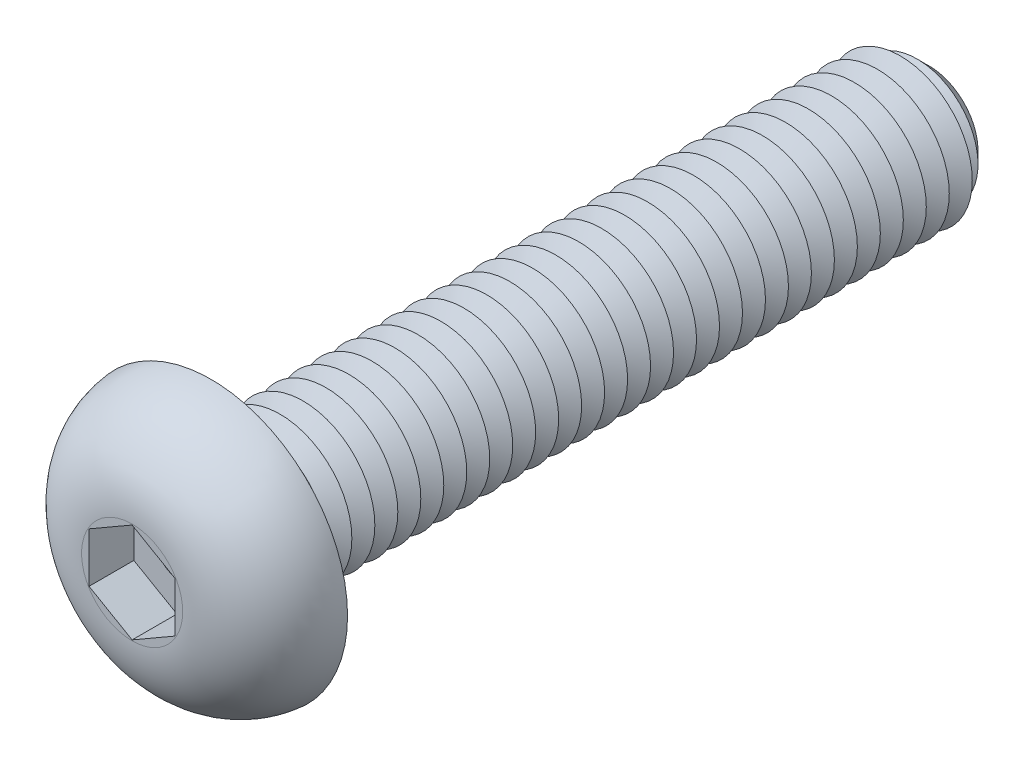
ISO-10303-21;
HEADER;
FILE_DESCRIPTION(('STEP AP214'),'2;1');
FILE_NAME('part.step','',(''),(''),'','','');
FILE_SCHEMA(('AUTOMOTIVE_DESIGN { 1 0 10303 214 1 1 1 1 }'));
ENDSEC;
DATA;
#1=APPLICATION_CONTEXT('core data for automotive mechanical design processes');
#2=APPLICATION_PROTOCOL_DEFINITION('international standard','automotive_design',2000,#1);
#3=PRODUCT_CONTEXT('',#1,'mechanical');
#4=PRODUCT('Part','Part','',(#3));
#5=PRODUCT_RELATED_PRODUCT_CATEGORY('part','',(#4));
#6=PRODUCT_DEFINITION_FORMATION('','',#4);
#7=PRODUCT_DEFINITION_CONTEXT('part definition',#1,'design');
#8=PRODUCT_DEFINITION('design','',#6,#7);
#9=PRODUCT_DEFINITION_SHAPE('','',#8);
#10=(LENGTH_UNIT() NAMED_UNIT(*) SI_UNIT(.MILLI.,.METRE.));
#11=(NAMED_UNIT(*) PLANE_ANGLE_UNIT() SI_UNIT($,.RADIAN.));
#12=(NAMED_UNIT(*) SI_UNIT($,.STERADIAN.) SOLID_ANGLE_UNIT());
#13=UNCERTAINTY_MEASURE_WITH_UNIT(LENGTH_MEASURE(1.E-05),#10,'distance_accuracy_value','');
#14=(GEOMETRIC_REPRESENTATION_CONTEXT(3) GLOBAL_UNCERTAINTY_ASSIGNED_CONTEXT((#13)) GLOBAL_UNIT_ASSIGNED_CONTEXT((#10,
#11,#12)) REPRESENTATION_CONTEXT('',''));
#15=CARTESIAN_POINT('',(0.,0.,0.));
#16=DIRECTION('',(0.,0.,1.));
#17=DIRECTION('',(1.,0.,0.));
#18=AXIS2_PLACEMENT_3D('',#15,#16,#17);
#19=CARTESIAN_POINT('',(0.,0.,-25.));
#20=DIRECTION('',(0.,0.,1.));
#21=DIRECTION('',(1.,0.,0.));
#22=AXIS2_PLACEMENT_3D('',#19,#20,#21);
#23=CYLINDRICAL_SURFACE('',#22,2.5);
#24=CARTESIAN_POINT('',(0.,0.,-0.400000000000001));
#25=DIRECTION('',(0.,0.,1.));
#26=DIRECTION('',(1.,0.,0.));
#27=AXIS2_PLACEMENT_3D('',#24,#25,#26);
#28=CIRCLE('',#27,2.5);
#29=CARTESIAN_POINT('',(2.5,0.,-0.400000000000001));
#30=VERTEX_POINT('',#29);
#31=EDGE_CURVE('E48',#30,#30,#28,.F.);
#32=ORIENTED_EDGE('',*,*,#31,.T.);
#33=EDGE_LOOP('',(#32));
#34=FACE_BOUND('',#33,.T.);
#35=CARTESIAN_POINT('',(0.,0.,-0.800000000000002));
#36=DIRECTION('',(0.,0.,1.));
#37=DIRECTION('',(1.,0.,0.));
#38=AXIS2_PLACEMENT_3D('',#35,#36,#37);
#39=CIRCLE('',#38,2.5);
#40=CARTESIAN_POINT('',(2.5,0.,-0.800000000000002));
#41=VERTEX_POINT('',#40);
#42=EDGE_CURVE('E138',#41,#41,#39,.T.);
#43=ORIENTED_EDGE('',*,*,#42,.T.);
#44=EDGE_LOOP('',(#43));
#45=FACE_BOUND('',#44,.T.);
#46=ADVANCED_FACE('F39',(#34,#45),#23,.T.);
#47=CARTESIAN_POINT('',(0.,4.75,0.));
#48=DIRECTION('',(0.,0.,1.));
#49=DIRECTION('',(1.,0.,0.));
#50=AXIS2_PLACEMENT_3D('',#47,#48,#49);
#51=PLANE('',#50);
#52=CARTESIAN_POINT('',(0.,0.,0.));
#53=DIRECTION('',(0.,0.,1.));
#54=DIRECTION('',(1.,0.,0.));
#55=AXIS2_PLACEMENT_3D('',#52,#53,#54);
#56=CIRCLE('',#55,2.9);
#57=CARTESIAN_POINT('',(2.9,0.,0.));
#58=VERTEX_POINT('',#57);
#59=EDGE_CURVE('E11',#58,#58,#56,.T.);
#60=ORIENTED_EDGE('',*,*,#59,.T.);
#61=EDGE_LOOP('',(#60));
#62=FACE_BOUND('',#61,.T.);
#63=CARTESIAN_POINT('',(0.,0.,0.));
#64=DIRECTION('',(0.,0.,1.));
#65=DIRECTION('',(1.,0.,0.));
#66=AXIS2_PLACEMENT_3D('',#63,#64,#65);
#67=CIRCLE('',#66,4.75);
#68=CARTESIAN_POINT('',(4.75,0.,0.));
#69=VERTEX_POINT('',#68);
#70=EDGE_CURVE('E157',#69,#69,#67,.T.);
#71=ORIENTED_EDGE('',*,*,#70,.F.);
#72=EDGE_LOOP('',(#71));
#73=FACE_BOUND('',#72,.T.);
#74=ADVANCED_FACE('F204',(#62,#73),#51,.F.);
#75=CARTESIAN_POINT('',(0.,0.,2.75));
#76=DIRECTION('',(0.,0.,-1.));
#77=DIRECTION('',(-1.,0.,0.));
#78=AXIS2_PLACEMENT_3D('',#75,#76,#77);
#79=PLANE('',#78);
#80=DIRECTION('',(-0.866025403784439,-0.5,0.));
#81=VECTOR('',#80,1.);
#82=CARTESIAN_POINT('',(0.,1.73205080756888,2.75));
#83=LINE('',#82,#81);
#84=CARTESIAN_POINT('',(0.,1.73205080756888,2.75));
#85=VERTEX_POINT('',#84);
#86=CARTESIAN_POINT('',(-1.5,0.866025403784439,2.75));
#87=VERTEX_POINT('',#86);
#88=EDGE_CURVE('E137',#85,#87,#83,.T.);
#89=ORIENTED_EDGE('',*,*,#88,.F.);
#90=DIRECTION('',(-0.866025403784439,0.5,0.));
#91=VECTOR('',#90,1.);
#92=CARTESIAN_POINT('',(1.5,0.86602540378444,2.75));
#93=LINE('',#92,#91);
#94=CARTESIAN_POINT('',(1.5,0.86602540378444,2.75));
#95=VERTEX_POINT('',#94);
#96=EDGE_CURVE('E55',#95,#85,#93,.T.);
#97=ORIENTED_EDGE('',*,*,#96,.F.);
#98=DIRECTION('',(0.,1.,0.));
#99=VECTOR('',#98,1.);
#100=CARTESIAN_POINT('',(1.5,-0.866025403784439,2.75));
#101=LINE('',#100,#99);
#102=CARTESIAN_POINT('',(1.5,-0.866025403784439,2.75));
#103=VERTEX_POINT('',#102);
#104=EDGE_CURVE('E151',#103,#95,#101,.T.);
#105=ORIENTED_EDGE('',*,*,#104,.F.);
#106=DIRECTION('',(0.866025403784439,0.5,0.));
#107=VECTOR('',#106,1.);
#108=CARTESIAN_POINT('',(0.,-1.73205080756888,2.75));
#109=LINE('',#108,#107);
#110=CARTESIAN_POINT('',(0.,-1.73205080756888,2.75));
#111=VERTEX_POINT('',#110);
#112=EDGE_CURVE('E148',#111,#103,#109,.T.);
#113=ORIENTED_EDGE('',*,*,#112,.F.);
#114=DIRECTION('',(0.866025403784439,-0.5,0.));
#115=VECTOR('',#114,1.);
#116=CARTESIAN_POINT('',(-1.5,-0.866025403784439,2.75));
#117=LINE('',#116,#115);
#118=CARTESIAN_POINT('',(-1.5,-0.866025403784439,2.75));
#119=VERTEX_POINT('',#118);
#120=EDGE_CURVE('E103',#119,#111,#117,.T.);
#121=ORIENTED_EDGE('',*,*,#120,.F.);
#122=DIRECTION('',(0.,-1.,0.));
#123=VECTOR('',#122,1.);
#124=CARTESIAN_POINT('',(-1.5,0.866025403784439,2.75));
#125=LINE('',#124,#123);
#126=EDGE_CURVE('E142',#87,#119,#125,.T.);
#127=ORIENTED_EDGE('',*,*,#126,.F.);
#128=EDGE_LOOP('',(#89,#97,#105,#113,#121,#127));
#129=FACE_BOUND('',#128,.T.);
#130=CARTESIAN_POINT('',(0.,0.,2.75));
#131=DIRECTION('',(0.,0.,1.));
#132=DIRECTION('',(1.,0.,0.));
#133=AXIS2_PLACEMENT_3D('',#130,#131,#132);
#134=CIRCLE('',#133,1.76043481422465);
#135=CARTESIAN_POINT('',(1.76043481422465,0.,2.75));
#136=VERTEX_POINT('',#135);
#137=EDGE_CURVE('E169',#136,#136,#134,.T.);
#138=ORIENTED_EDGE('',*,*,#137,.T.);
#139=EDGE_LOOP('',(#138));
#140=FACE_BOUND('',#139,.T.);
#141=ADVANCED_FACE('F209',(#129,#140),#79,.F.);
#142=CARTESIAN_POINT('',(0.,0.,-0.25));
#143=DIRECTION('',(0.,0.,1.));
#144=DIRECTION('',(1.,0.,0.));
#145=AXIS2_PLACEMENT_3D('',#142,#143,#144);
#146=DEGENERATE_TOROIDAL_SURFACE('',#145,1.76043481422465,3.,.T.);
#147=ORIENTED_EDGE('',*,*,#137,.F.);
#148=EDGE_LOOP('',(#147));
#149=FACE_BOUND('',#148,.T.);
#150=ORIENTED_EDGE('',*,*,#70,.T.);
#151=EDGE_LOOP('',(#150));
#152=FACE_BOUND('',#151,.T.);
#153=ADVANCED_FACE('F237',(#149,#152),#146,.T.);
#154=CARTESIAN_POINT('',(1.5,0.86602540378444,1.19));
#155=DIRECTION('',(0.5,0.866025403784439,0.));
#156=DIRECTION('',(-0.866025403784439,0.5,0.));
#157=AXIS2_PLACEMENT_3D('',#154,#155,#156);
#158=PLANE('',#157);
#159=ORIENTED_EDGE('',*,*,#96,.T.);
#160=DIRECTION('',(0.,0.,1.));
#161=VECTOR('',#160,1.);
#162=CARTESIAN_POINT('',(0.,1.73205080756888,1.19));
#163=LINE('',#162,#161);
#164=CARTESIAN_POINT('',(0.,1.73205080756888,1.19));
#165=VERTEX_POINT('',#164);
#166=EDGE_CURVE('E85',#165,#85,#163,.T.);
#167=ORIENTED_EDGE('',*,*,#166,.F.);
#168=DIRECTION('',(-0.866025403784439,0.5,0.));
#169=VECTOR('',#168,1.);
#170=CARTESIAN_POINT('',(1.5,0.86602540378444,1.19));
#171=LINE('',#170,#169);
#172=CARTESIAN_POINT('',(1.5,0.86602540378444,1.19));
#173=VERTEX_POINT('',#172);
#174=EDGE_CURVE('E154',#173,#165,#171,.T.);
#175=ORIENTED_EDGE('',*,*,#174,.F.);
#176=DIRECTION('',(0.,0.,1.));
#177=VECTOR('',#176,1.);
#178=CARTESIAN_POINT('',(1.5,0.86602540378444,1.19));
#179=LINE('',#178,#177);
#180=EDGE_CURVE('E63',#173,#95,#179,.T.);
#181=ORIENTED_EDGE('',*,*,#180,.T.);
#182=EDGE_LOOP('',(#159,#167,#175,#181));
#183=FACE_BOUND('',#182,.T.);
#184=ADVANCED_FACE('F223',(#183),#158,.F.);
#185=CARTESIAN_POINT('',(1.5,-0.866025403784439,1.19));
#186=DIRECTION('',(1.,0.,0.));
#187=DIRECTION('',(0.,1.,0.));
#188=AXIS2_PLACEMENT_3D('',#185,#186,#187);
#189=PLANE('',#188);
#190=ORIENTED_EDGE('',*,*,#104,.T.);
#191=ORIENTED_EDGE('',*,*,#180,.F.);
#192=DIRECTION('',(0.,1.,0.));
#193=VECTOR('',#192,1.);
#194=CARTESIAN_POINT('',(1.5,-0.866025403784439,1.19));
#195=LINE('',#194,#193);
#196=CARTESIAN_POINT('',(1.5,-0.866025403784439,1.19));
#197=VERTEX_POINT('',#196);
#198=EDGE_CURVE('E117',#197,#173,#195,.T.);
#199=ORIENTED_EDGE('',*,*,#198,.F.);
#200=DIRECTION('',(0.,0.,1.));
#201=VECTOR('',#200,1.);
#202=CARTESIAN_POINT('',(1.5,-0.866025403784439,1.19));
#203=LINE('',#202,#201);
#204=EDGE_CURVE('E108',#197,#103,#203,.T.);
#205=ORIENTED_EDGE('',*,*,#204,.T.);
#206=EDGE_LOOP('',(#190,#191,#199,#205));
#207=FACE_BOUND('',#206,.T.);
#208=ADVANCED_FACE('F220',(#207),#189,.F.);
#209=CARTESIAN_POINT('',(0.,-1.73205080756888,1.19));
#210=DIRECTION('',(0.5,-0.866025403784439,0.));
#211=DIRECTION('',(0.866025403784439,0.5,0.));
#212=AXIS2_PLACEMENT_3D('',#209,#210,#211);
#213=PLANE('',#212);
#214=ORIENTED_EDGE('',*,*,#112,.T.);
#215=ORIENTED_EDGE('',*,*,#204,.F.);
#216=DIRECTION('',(0.866025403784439,0.5,0.));
#217=VECTOR('',#216,1.);
#218=CARTESIAN_POINT('',(0.,-1.73205080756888,1.19));
#219=LINE('',#218,#217);
#220=CARTESIAN_POINT('',(0.,-1.73205080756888,1.19));
#221=VERTEX_POINT('',#220);
#222=EDGE_CURVE('E112',#221,#197,#219,.T.);
#223=ORIENTED_EDGE('',*,*,#222,.F.);
#224=DIRECTION('',(0.,0.,1.));
#225=VECTOR('',#224,1.);
#226=CARTESIAN_POINT('',(0.,-1.73205080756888,1.19));
#227=LINE('',#226,#225);
#228=EDGE_CURVE('E96',#221,#111,#227,.T.);
#229=ORIENTED_EDGE('',*,*,#228,.T.);
#230=EDGE_LOOP('',(#214,#215,#223,#229));
#231=FACE_BOUND('',#230,.T.);
#232=ADVANCED_FACE('F113',(#231),#213,.F.);
#233=CARTESIAN_POINT('',(-1.5,-0.866025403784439,1.19));
#234=DIRECTION('',(-0.5,-0.866025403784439,0.));
#235=DIRECTION('',(0.866025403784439,-0.5,0.));
#236=AXIS2_PLACEMENT_3D('',#233,#234,#235);
#237=PLANE('',#236);
#238=ORIENTED_EDGE('',*,*,#120,.T.);
#239=ORIENTED_EDGE('',*,*,#228,.F.);
#240=DIRECTION('',(0.866025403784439,-0.5,0.));
#241=VECTOR('',#240,1.);
#242=CARTESIAN_POINT('',(-1.5,-0.866025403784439,1.19));
#243=LINE('',#242,#241);
#244=CARTESIAN_POINT('',(-1.5,-0.866025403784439,1.19));
#245=VERTEX_POINT('',#244);
#246=EDGE_CURVE('E100',#245,#221,#243,.T.);
#247=ORIENTED_EDGE('',*,*,#246,.F.);
#248=DIRECTION('',(0.,0.,1.));
#249=VECTOR('',#248,1.);
#250=CARTESIAN_POINT('',(-1.5,-0.866025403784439,1.19));
#251=LINE('',#250,#249);
#252=EDGE_CURVE('E109',#245,#119,#251,.T.);
#253=ORIENTED_EDGE('',*,*,#252,.T.);
#254=EDGE_LOOP('',(#238,#239,#247,#253));
#255=FACE_BOUND('',#254,.T.);
#256=ADVANCED_FACE('F98',(#255),#237,.F.);
#257=CARTESIAN_POINT('',(-1.5,0.866025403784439,1.19));
#258=DIRECTION('',(-1.,0.,0.));
#259=DIRECTION('',(0.,-1.,0.));
#260=AXIS2_PLACEMENT_3D('',#257,#258,#259);
#261=PLANE('',#260);
#262=ORIENTED_EDGE('',*,*,#126,.T.);
#263=ORIENTED_EDGE('',*,*,#252,.F.);
#264=DIRECTION('',(0.,-1.,0.));
#265=VECTOR('',#264,1.);
#266=CARTESIAN_POINT('',(-1.5,0.866025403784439,1.19));
#267=LINE('',#266,#265);
#268=CARTESIAN_POINT('',(-1.5,0.866025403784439,1.19));
#269=VERTEX_POINT('',#268);
#270=EDGE_CURVE('E123',#269,#245,#267,.T.);
#271=ORIENTED_EDGE('',*,*,#270,.F.);
#272=DIRECTION('',(0.,0.,1.));
#273=VECTOR('',#272,1.);
#274=CARTESIAN_POINT('',(-1.5,0.866025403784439,1.19));
#275=LINE('',#274,#273);
#276=EDGE_CURVE('E161',#269,#87,#275,.T.);
#277=ORIENTED_EDGE('',*,*,#276,.T.);
#278=EDGE_LOOP('',(#262,#263,#271,#277));
#279=FACE_BOUND('',#278,.T.);
#280=ADVANCED_FACE('F228',(#279),#261,.F.);
#281=CARTESIAN_POINT('',(0.,1.73205080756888,1.19));
#282=DIRECTION('',(-0.5,0.866025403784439,0.));
#283=DIRECTION('',(-0.866025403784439,-0.5,0.));
#284=AXIS2_PLACEMENT_3D('',#281,#282,#283);
#285=PLANE('',#284);
#286=ORIENTED_EDGE('',*,*,#88,.T.);
#287=ORIENTED_EDGE('',*,*,#276,.F.);
#288=DIRECTION('',(-0.866025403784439,-0.5,0.));
#289=VECTOR('',#288,1.);
#290=CARTESIAN_POINT('',(0.,1.73205080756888,1.19));
#291=LINE('',#290,#289);
#292=EDGE_CURVE('E129',#165,#269,#291,.T.);
#293=ORIENTED_EDGE('',*,*,#292,.F.);
#294=ORIENTED_EDGE('',*,*,#166,.T.);
#295=EDGE_LOOP('',(#286,#287,#293,#294));
#296=FACE_BOUND('',#295,.T.);
#297=ADVANCED_FACE('F218',(#296),#285,.F.);
#298=CARTESIAN_POINT('',(0.,0.,1.19));
#299=DIRECTION('',(0.,0.,1.));
#300=DIRECTION('',(1.,0.,0.));
#301=AXIS2_PLACEMENT_3D('',#298,#299,#300);
#302=PLANE('',#301);
#303=CARTESIAN_POINT('',(0.,0.,1.19));
#304=DIRECTION('',(0.,0.,1.));
#305=DIRECTION('',(1.,0.,0.));
#306=AXIS2_PLACEMENT_3D('',#303,#304,#305);
#307=CIRCLE('',#306,0.65);
#308=CARTESIAN_POINT('',(0.65,0.,1.19));
#309=VERTEX_POINT('',#308);
#310=EDGE_CURVE('E495',#309,#309,#307,.T.);
#311=ORIENTED_EDGE('',*,*,#310,.F.);
#312=EDGE_LOOP('',(#311));
#313=FACE_BOUND('',#312,.T.);
#314=ORIENTED_EDGE('',*,*,#174,.T.);
#315=ORIENTED_EDGE('',*,*,#292,.T.);
#316=ORIENTED_EDGE('',*,*,#270,.T.);
#317=ORIENTED_EDGE('',*,*,#246,.T.);
#318=ORIENTED_EDGE('',*,*,#222,.T.);
#319=ORIENTED_EDGE('',*,*,#198,.T.);
#320=EDGE_LOOP('',(#314,#315,#316,#317,#318,#319));
#321=FACE_BOUND('',#320,.T.);
#322=ADVANCED_FACE('F120',(#313,#321),#302,.T.);
#323=CARTESIAN_POINT('',(0.,0.,-0.800000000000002));
#324=DIRECTION('',(0.,0.,1.));
#325=DIRECTION('',(1.,0.,0.));
#326=AXIS2_PLACEMENT_3D('',#323,#324,#325);
#327=CONICAL_SURFACE('',#326,2.5,1.0471975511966);
#328=CARTESIAN_POINT('',(0.,0.,-1.2));
#329=DIRECTION('',(0.,0.,1.));
#330=DIRECTION('',(1.,0.,0.));
#331=AXIS2_PLACEMENT_3D('',#328,#329,#330);
#332=CIRCLE('',#331,1.80717967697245);
#333=CARTESIAN_POINT('',(1.80717967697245,0.,-1.2));
#334=VERTEX_POINT('',#333);
#335=EDGE_CURVE('E260',#334,#334,#332,.T.);
#336=ORIENTED_EDGE('',*,*,#335,.T.);
#337=EDGE_LOOP('',(#336));
#338=FACE_BOUND('',#337,.T.);
#339=ORIENTED_EDGE('',*,*,#42,.F.);
#340=EDGE_LOOP('',(#339));
#341=FACE_BOUND('',#340,.T.);
#342=ADVANCED_FACE('F217',(#338,#341),#327,.T.);
#343=CARTESIAN_POINT('',(0.,0.,-1.2));
#344=DIRECTION('',(0.,0.,-1.));
#345=DIRECTION('',(-1.,0.,0.));
#346=AXIS2_PLACEMENT_3D('',#343,#344,#345);
#347=CONICAL_SURFACE('',#346,1.80717967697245,1.0471975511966);
#348=CARTESIAN_POINT('',(0.,0.,-1.6));
#349=DIRECTION('',(0.,0.,1.));
#350=DIRECTION('',(1.,0.,0.));
#351=AXIS2_PLACEMENT_3D('',#348,#349,#350);
#352=CIRCLE('',#351,2.5);
#353=CARTESIAN_POINT('',(2.5,0.,-1.6));
#354=VERTEX_POINT('',#353);
#355=EDGE_CURVE('E264',#354,#354,#352,.T.);
#356=ORIENTED_EDGE('',*,*,#355,.T.);
#357=EDGE_LOOP('',(#356));
#358=FACE_BOUND('',#357,.T.);
#359=ORIENTED_EDGE('',*,*,#335,.F.);
#360=EDGE_LOOP('',(#359));
#361=FACE_BOUND('',#360,.T.);
#362=ADVANCED_FACE('F853',(#358,#361),#347,.T.);
#363=CARTESIAN_POINT('',(0.,0.,-1.6));
#364=DIRECTION('',(0.,0.,1.));
#365=DIRECTION('',(1.,0.,0.));
#366=AXIS2_PLACEMENT_3D('',#363,#364,#365);
#367=CONICAL_SURFACE('',#366,2.5,1.0471975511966);
#368=CARTESIAN_POINT('',(0.,0.,-2.));
#369=DIRECTION('',(0.,0.,1.));
#370=DIRECTION('',(1.,0.,0.));
#371=AXIS2_PLACEMENT_3D('',#368,#369,#370);
#372=CIRCLE('',#371,1.80717967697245);
#373=CARTESIAN_POINT('',(1.80717967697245,0.,-2.));
#374=VERTEX_POINT('',#373);
#375=EDGE_CURVE('E268',#374,#374,#372,.T.);
#376=ORIENTED_EDGE('',*,*,#375,.T.);
#377=EDGE_LOOP('',(#376));
#378=FACE_BOUND('',#377,.T.);
#379=ORIENTED_EDGE('',*,*,#355,.F.);
#380=EDGE_LOOP('',(#379));
#381=FACE_BOUND('',#380,.T.);
#382=ADVANCED_FACE('F847',(#378,#381),#367,.T.);
#383=CARTESIAN_POINT('',(0.,0.,-2.));
#384=DIRECTION('',(0.,0.,-1.));
#385=DIRECTION('',(-1.,0.,0.));
#386=AXIS2_PLACEMENT_3D('',#383,#384,#385);
#387=CONICAL_SURFACE('',#386,1.80717967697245,1.0471975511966);
#388=CARTESIAN_POINT('',(0.,0.,-2.4));
#389=DIRECTION('',(0.,0.,1.));
#390=DIRECTION('',(1.,0.,0.));
#391=AXIS2_PLACEMENT_3D('',#388,#389,#390);
#392=CIRCLE('',#391,2.5);
#393=CARTESIAN_POINT('',(2.5,0.,-2.4));
#394=VERTEX_POINT('',#393);
#395=EDGE_CURVE('E272',#394,#394,#392,.T.);
#396=ORIENTED_EDGE('',*,*,#395,.T.);
#397=EDGE_LOOP('',(#396));
#398=FACE_BOUND('',#397,.T.);
#399=ORIENTED_EDGE('',*,*,#375,.F.);
#400=EDGE_LOOP('',(#399));
#401=FACE_BOUND('',#400,.T.);
#402=ADVANCED_FACE('F841',(#398,#401),#387,.T.);
#403=CARTESIAN_POINT('',(0.,0.,-2.4));
#404=DIRECTION('',(0.,0.,1.));
#405=DIRECTION('',(1.,0.,0.));
#406=AXIS2_PLACEMENT_3D('',#403,#404,#405);
#407=CONICAL_SURFACE('',#406,2.5,1.0471975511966);
#408=CARTESIAN_POINT('',(0.,0.,-2.8));
#409=DIRECTION('',(0.,0.,1.));
#410=DIRECTION('',(1.,0.,0.));
#411=AXIS2_PLACEMENT_3D('',#408,#409,#410);
#412=CIRCLE('',#411,1.80717967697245);
#413=CARTESIAN_POINT('',(1.80717967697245,0.,-2.8));
#414=VERTEX_POINT('',#413);
#415=EDGE_CURVE('E276',#414,#414,#412,.T.);
#416=ORIENTED_EDGE('',*,*,#415,.T.);
#417=EDGE_LOOP('',(#416));
#418=FACE_BOUND('',#417,.T.);
#419=ORIENTED_EDGE('',*,*,#395,.F.);
#420=EDGE_LOOP('',(#419));
#421=FACE_BOUND('',#420,.T.);
#422=ADVANCED_FACE('F835',(#418,#421),#407,.T.);
#423=CARTESIAN_POINT('',(0.,0.,-2.8));
#424=DIRECTION('',(0.,0.,-1.));
#425=DIRECTION('',(-1.,0.,0.));
#426=AXIS2_PLACEMENT_3D('',#423,#424,#425);
#427=CONICAL_SURFACE('',#426,1.80717967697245,1.0471975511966);
#428=CARTESIAN_POINT('',(0.,0.,-3.2));
#429=DIRECTION('',(0.,0.,1.));
#430=DIRECTION('',(1.,0.,0.));
#431=AXIS2_PLACEMENT_3D('',#428,#429,#430);
#432=CIRCLE('',#431,2.5);
#433=CARTESIAN_POINT('',(2.5,0.,-3.2));
#434=VERTEX_POINT('',#433);
#435=EDGE_CURVE('E280',#434,#434,#432,.T.);
#436=ORIENTED_EDGE('',*,*,#435,.T.);
#437=EDGE_LOOP('',(#436));
#438=FACE_BOUND('',#437,.T.);
#439=ORIENTED_EDGE('',*,*,#415,.F.);
#440=EDGE_LOOP('',(#439));
#441=FACE_BOUND('',#440,.T.);
#442=ADVANCED_FACE('F829',(#438,#441),#427,.T.);
#443=CARTESIAN_POINT('',(0.,0.,-3.2));
#444=DIRECTION('',(0.,0.,1.));
#445=DIRECTION('',(1.,0.,0.));
#446=AXIS2_PLACEMENT_3D('',#443,#444,#445);
#447=CONICAL_SURFACE('',#446,2.5,1.0471975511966);
#448=CARTESIAN_POINT('',(0.,0.,-3.6));
#449=DIRECTION('',(0.,0.,1.));
#450=DIRECTION('',(1.,0.,0.));
#451=AXIS2_PLACEMENT_3D('',#448,#449,#450);
#452=CIRCLE('',#451,1.80717967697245);
#453=CARTESIAN_POINT('',(1.80717967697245,0.,-3.6));
#454=VERTEX_POINT('',#453);
#455=EDGE_CURVE('E284',#454,#454,#452,.T.);
#456=ORIENTED_EDGE('',*,*,#455,.T.);
#457=EDGE_LOOP('',(#456));
#458=FACE_BOUND('',#457,.T.);
#459=ORIENTED_EDGE('',*,*,#435,.F.);
#460=EDGE_LOOP('',(#459));
#461=FACE_BOUND('',#460,.T.);
#462=ADVANCED_FACE('F823',(#458,#461),#447,.T.);
#463=CARTESIAN_POINT('',(0.,0.,-3.6));
#464=DIRECTION('',(0.,0.,-1.));
#465=DIRECTION('',(-1.,0.,0.));
#466=AXIS2_PLACEMENT_3D('',#463,#464,#465);
#467=CONICAL_SURFACE('',#466,1.80717967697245,1.0471975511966);
#468=CARTESIAN_POINT('',(0.,0.,-4.));
#469=DIRECTION('',(0.,0.,1.));
#470=DIRECTION('',(1.,0.,0.));
#471=AXIS2_PLACEMENT_3D('',#468,#469,#470);
#472=CIRCLE('',#471,2.5);
#473=CARTESIAN_POINT('',(2.5,0.,-4.));
#474=VERTEX_POINT('',#473);
#475=EDGE_CURVE('E288',#474,#474,#472,.T.);
#476=ORIENTED_EDGE('',*,*,#475,.T.);
#477=EDGE_LOOP('',(#476));
#478=FACE_BOUND('',#477,.T.);
#479=ORIENTED_EDGE('',*,*,#455,.F.);
#480=EDGE_LOOP('',(#479));
#481=FACE_BOUND('',#480,.T.);
#482=ADVANCED_FACE('F817',(#478,#481),#467,.T.);
#483=CARTESIAN_POINT('',(0.,0.,-4.));
#484=DIRECTION('',(0.,0.,1.));
#485=DIRECTION('',(1.,0.,0.));
#486=AXIS2_PLACEMENT_3D('',#483,#484,#485);
#487=CONICAL_SURFACE('',#486,2.5,1.0471975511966);
#488=CARTESIAN_POINT('',(0.,0.,-4.4));
#489=DIRECTION('',(0.,0.,1.));
#490=DIRECTION('',(1.,0.,0.));
#491=AXIS2_PLACEMENT_3D('',#488,#489,#490);
#492=CIRCLE('',#491,1.80717967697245);
#493=CARTESIAN_POINT('',(1.80717967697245,0.,-4.4));
#494=VERTEX_POINT('',#493);
#495=EDGE_CURVE('E292',#494,#494,#492,.T.);
#496=ORIENTED_EDGE('',*,*,#495,.T.);
#497=EDGE_LOOP('',(#496));
#498=FACE_BOUND('',#497,.T.);
#499=ORIENTED_EDGE('',*,*,#475,.F.);
#500=EDGE_LOOP('',(#499));
#501=FACE_BOUND('',#500,.T.);
#502=ADVANCED_FACE('F811',(#498,#501),#487,.T.);
#503=CARTESIAN_POINT('',(0.,0.,-4.4));
#504=DIRECTION('',(0.,0.,-1.));
#505=DIRECTION('',(-1.,0.,0.));
#506=AXIS2_PLACEMENT_3D('',#503,#504,#505);
#507=CONICAL_SURFACE('',#506,1.80717967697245,1.0471975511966);
#508=CARTESIAN_POINT('',(0.,0.,-4.8));
#509=DIRECTION('',(0.,0.,1.));
#510=DIRECTION('',(1.,0.,0.));
#511=AXIS2_PLACEMENT_3D('',#508,#509,#510);
#512=CIRCLE('',#511,2.5);
#513=CARTESIAN_POINT('',(2.5,0.,-4.8));
#514=VERTEX_POINT('',#513);
#515=EDGE_CURVE('E296',#514,#514,#512,.T.);
#516=ORIENTED_EDGE('',*,*,#515,.T.);
#517=EDGE_LOOP('',(#516));
#518=FACE_BOUND('',#517,.T.);
#519=ORIENTED_EDGE('',*,*,#495,.F.);
#520=EDGE_LOOP('',(#519));
#521=FACE_BOUND('',#520,.T.);
#522=ADVANCED_FACE('F805',(#518,#521),#507,.T.);
#523=CARTESIAN_POINT('',(0.,0.,-4.8));
#524=DIRECTION('',(0.,0.,1.));
#525=DIRECTION('',(1.,0.,0.));
#526=AXIS2_PLACEMENT_3D('',#523,#524,#525);
#527=CONICAL_SURFACE('',#526,2.5,1.0471975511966);
#528=CARTESIAN_POINT('',(0.,0.,-5.2));
#529=DIRECTION('',(0.,0.,1.));
#530=DIRECTION('',(1.,0.,0.));
#531=AXIS2_PLACEMENT_3D('',#528,#529,#530);
#532=CIRCLE('',#531,1.80717967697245);
#533=CARTESIAN_POINT('',(1.80717967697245,0.,-5.2));
#534=VERTEX_POINT('',#533);
#535=EDGE_CURVE('E300',#534,#534,#532,.T.);
#536=ORIENTED_EDGE('',*,*,#535,.T.);
#537=EDGE_LOOP('',(#536));
#538=FACE_BOUND('',#537,.T.);
#539=ORIENTED_EDGE('',*,*,#515,.F.);
#540=EDGE_LOOP('',(#539));
#541=FACE_BOUND('',#540,.T.);
#542=ADVANCED_FACE('F799',(#538,#541),#527,.T.);
#543=CARTESIAN_POINT('',(0.,0.,-5.2));
#544=DIRECTION('',(0.,0.,-1.));
#545=DIRECTION('',(-1.,0.,0.));
#546=AXIS2_PLACEMENT_3D('',#543,#544,#545);
#547=CONICAL_SURFACE('',#546,1.80717967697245,1.0471975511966);
#548=CARTESIAN_POINT('',(0.,0.,-5.6));
#549=DIRECTION('',(0.,0.,1.));
#550=DIRECTION('',(1.,0.,0.));
#551=AXIS2_PLACEMENT_3D('',#548,#549,#550);
#552=CIRCLE('',#551,2.5);
#553=CARTESIAN_POINT('',(2.5,0.,-5.6));
#554=VERTEX_POINT('',#553);
#555=EDGE_CURVE('E304',#554,#554,#552,.T.);
#556=ORIENTED_EDGE('',*,*,#555,.T.);
#557=EDGE_LOOP('',(#556));
#558=FACE_BOUND('',#557,.T.);
#559=ORIENTED_EDGE('',*,*,#535,.F.);
#560=EDGE_LOOP('',(#559));
#561=FACE_BOUND('',#560,.T.);
#562=ADVANCED_FACE('F793',(#558,#561),#547,.T.);
#563=CARTESIAN_POINT('',(0.,0.,-5.6));
#564=DIRECTION('',(0.,0.,1.));
#565=DIRECTION('',(1.,0.,0.));
#566=AXIS2_PLACEMENT_3D('',#563,#564,#565);
#567=CONICAL_SURFACE('',#566,2.5,1.0471975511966);
#568=CARTESIAN_POINT('',(0.,0.,-6.));
#569=DIRECTION('',(0.,0.,1.));
#570=DIRECTION('',(1.,0.,0.));
#571=AXIS2_PLACEMENT_3D('',#568,#569,#570);
#572=CIRCLE('',#571,1.80717967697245);
#573=CARTESIAN_POINT('',(1.80717967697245,0.,-6.));
#574=VERTEX_POINT('',#573);
#575=EDGE_CURVE('E308',#574,#574,#572,.T.);
#576=ORIENTED_EDGE('',*,*,#575,.T.);
#577=EDGE_LOOP('',(#576));
#578=FACE_BOUND('',#577,.T.);
#579=ORIENTED_EDGE('',*,*,#555,.F.);
#580=EDGE_LOOP('',(#579));
#581=FACE_BOUND('',#580,.T.);
#582=ADVANCED_FACE('F787',(#578,#581),#567,.T.);
#583=CARTESIAN_POINT('',(0.,0.,-6.));
#584=DIRECTION('',(0.,0.,-1.));
#585=DIRECTION('',(-1.,0.,0.));
#586=AXIS2_PLACEMENT_3D('',#583,#584,#585);
#587=CONICAL_SURFACE('',#586,1.80717967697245,1.0471975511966);
#588=CARTESIAN_POINT('',(0.,0.,-6.4));
#589=DIRECTION('',(0.,0.,1.));
#590=DIRECTION('',(1.,0.,0.));
#591=AXIS2_PLACEMENT_3D('',#588,#589,#590);
#592=CIRCLE('',#591,2.5);
#593=CARTESIAN_POINT('',(2.5,0.,-6.4));
#594=VERTEX_POINT('',#593);
#595=EDGE_CURVE('E312',#594,#594,#592,.T.);
#596=ORIENTED_EDGE('',*,*,#595,.T.);
#597=EDGE_LOOP('',(#596));
#598=FACE_BOUND('',#597,.T.);
#599=ORIENTED_EDGE('',*,*,#575,.F.);
#600=EDGE_LOOP('',(#599));
#601=FACE_BOUND('',#600,.T.);
#602=ADVANCED_FACE('F781',(#598,#601),#587,.T.);
#603=CARTESIAN_POINT('',(0.,0.,-6.4));
#604=DIRECTION('',(0.,0.,1.));
#605=DIRECTION('',(1.,0.,0.));
#606=AXIS2_PLACEMENT_3D('',#603,#604,#605);
#607=CONICAL_SURFACE('',#606,2.5,1.0471975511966);
#608=CARTESIAN_POINT('',(0.,0.,-6.8));
#609=DIRECTION('',(0.,0.,1.));
#610=DIRECTION('',(1.,0.,0.));
#611=AXIS2_PLACEMENT_3D('',#608,#609,#610);
#612=CIRCLE('',#611,1.80717967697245);
#613=CARTESIAN_POINT('',(1.80717967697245,0.,-6.8));
#614=VERTEX_POINT('',#613);
#615=EDGE_CURVE('E316',#614,#614,#612,.T.);
#616=ORIENTED_EDGE('',*,*,#615,.T.);
#617=EDGE_LOOP('',(#616));
#618=FACE_BOUND('',#617,.T.);
#619=ORIENTED_EDGE('',*,*,#595,.F.);
#620=EDGE_LOOP('',(#619));
#621=FACE_BOUND('',#620,.T.);
#622=ADVANCED_FACE('F775',(#618,#621),#607,.T.);
#623=CARTESIAN_POINT('',(0.,0.,-6.8));
#624=DIRECTION('',(0.,0.,-1.));
#625=DIRECTION('',(-1.,0.,0.));
#626=AXIS2_PLACEMENT_3D('',#623,#624,#625);
#627=CONICAL_SURFACE('',#626,1.80717967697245,1.0471975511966);
#628=CARTESIAN_POINT('',(0.,0.,-7.2));
#629=DIRECTION('',(0.,0.,1.));
#630=DIRECTION('',(1.,0.,0.));
#631=AXIS2_PLACEMENT_3D('',#628,#629,#630);
#632=CIRCLE('',#631,2.5);
#633=CARTESIAN_POINT('',(2.5,0.,-7.2));
#634=VERTEX_POINT('',#633);
#635=EDGE_CURVE('E320',#634,#634,#632,.T.);
#636=ORIENTED_EDGE('',*,*,#635,.T.);
#637=EDGE_LOOP('',(#636));
#638=FACE_BOUND('',#637,.T.);
#639=ORIENTED_EDGE('',*,*,#615,.F.);
#640=EDGE_LOOP('',(#639));
#641=FACE_BOUND('',#640,.T.);
#642=ADVANCED_FACE('F769',(#638,#641),#627,.T.);
#643=CARTESIAN_POINT('',(0.,0.,-7.2));
#644=DIRECTION('',(0.,0.,1.));
#645=DIRECTION('',(1.,0.,0.));
#646=AXIS2_PLACEMENT_3D('',#643,#644,#645);
#647=CONICAL_SURFACE('',#646,2.5,1.0471975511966);
#648=CARTESIAN_POINT('',(0.,0.,-7.6));
#649=DIRECTION('',(0.,0.,1.));
#650=DIRECTION('',(1.,0.,0.));
#651=AXIS2_PLACEMENT_3D('',#648,#649,#650);
#652=CIRCLE('',#651,1.80717967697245);
#653=CARTESIAN_POINT('',(1.80717967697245,0.,-7.6));
#654=VERTEX_POINT('',#653);
#655=EDGE_CURVE('E323',#654,#654,#652,.T.);
#656=ORIENTED_EDGE('',*,*,#655,.T.);
#657=EDGE_LOOP('',(#656));
#658=FACE_BOUND('',#657,.T.);
#659=ORIENTED_EDGE('',*,*,#635,.F.);
#660=EDGE_LOOP('',(#659));
#661=FACE_BOUND('',#660,.T.);
#662=ADVANCED_FACE('F763',(#658,#661),#647,.T.);
#663=CARTESIAN_POINT('',(0.,0.,-7.6));
#664=DIRECTION('',(0.,0.,-1.));
#665=DIRECTION('',(-1.,0.,0.));
#666=AXIS2_PLACEMENT_3D('',#663,#664,#665);
#667=CONICAL_SURFACE('',#666,1.80717967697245,1.0471975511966);
#668=CARTESIAN_POINT('',(0.,0.,-8.));
#669=DIRECTION('',(0.,0.,1.));
#670=DIRECTION('',(1.,0.,0.));
#671=AXIS2_PLACEMENT_3D('',#668,#669,#670);
#672=CIRCLE('',#671,2.5);
#673=CARTESIAN_POINT('',(2.5,0.,-8.));
#674=VERTEX_POINT('',#673);
#675=EDGE_CURVE('E327',#674,#674,#672,.T.);
#676=ORIENTED_EDGE('',*,*,#675,.T.);
#677=EDGE_LOOP('',(#676));
#678=FACE_BOUND('',#677,.T.);
#679=ORIENTED_EDGE('',*,*,#655,.F.);
#680=EDGE_LOOP('',(#679));
#681=FACE_BOUND('',#680,.T.);
#682=ADVANCED_FACE('F757',(#678,#681),#667,.T.);
#683=CARTESIAN_POINT('',(0.,0.,-8.));
#684=DIRECTION('',(0.,0.,1.));
#685=DIRECTION('',(1.,0.,0.));
#686=AXIS2_PLACEMENT_3D('',#683,#684,#685);
#687=CONICAL_SURFACE('',#686,2.5,1.0471975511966);
#688=CARTESIAN_POINT('',(0.,0.,-8.4));
#689=DIRECTION('',(0.,0.,1.));
#690=DIRECTION('',(1.,0.,0.));
#691=AXIS2_PLACEMENT_3D('',#688,#689,#690);
#692=CIRCLE('',#691,1.80717967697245);
#693=CARTESIAN_POINT('',(1.80717967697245,0.,-8.4));
#694=VERTEX_POINT('',#693);
#695=EDGE_CURVE('E331',#694,#694,#692,.T.);
#696=ORIENTED_EDGE('',*,*,#695,.T.);
#697=EDGE_LOOP('',(#696));
#698=FACE_BOUND('',#697,.T.);
#699=ORIENTED_EDGE('',*,*,#675,.F.);
#700=EDGE_LOOP('',(#699));
#701=FACE_BOUND('',#700,.T.);
#702=ADVANCED_FACE('F751',(#698,#701),#687,.T.);
#703=CARTESIAN_POINT('',(0.,0.,-8.4));
#704=DIRECTION('',(0.,0.,-1.));
#705=DIRECTION('',(-1.,0.,0.));
#706=AXIS2_PLACEMENT_3D('',#703,#704,#705);
#707=CONICAL_SURFACE('',#706,1.80717967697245,1.0471975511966);
#708=CARTESIAN_POINT('',(0.,0.,-8.8));
#709=DIRECTION('',(0.,0.,1.));
#710=DIRECTION('',(1.,0.,0.));
#711=AXIS2_PLACEMENT_3D('',#708,#709,#710);
#712=CIRCLE('',#711,2.5);
#713=CARTESIAN_POINT('',(2.5,0.,-8.8));
#714=VERTEX_POINT('',#713);
#715=EDGE_CURVE('E335',#714,#714,#712,.T.);
#716=ORIENTED_EDGE('',*,*,#715,.T.);
#717=EDGE_LOOP('',(#716));
#718=FACE_BOUND('',#717,.T.);
#719=ORIENTED_EDGE('',*,*,#695,.F.);
#720=EDGE_LOOP('',(#719));
#721=FACE_BOUND('',#720,.T.);
#722=ADVANCED_FACE('F745',(#718,#721),#707,.T.);
#723=CARTESIAN_POINT('',(0.,0.,-8.8));
#724=DIRECTION('',(0.,0.,1.));
#725=DIRECTION('',(1.,0.,0.));
#726=AXIS2_PLACEMENT_3D('',#723,#724,#725);
#727=CONICAL_SURFACE('',#726,2.5,1.0471975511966);
#728=CARTESIAN_POINT('',(0.,0.,-9.2));
#729=DIRECTION('',(0.,0.,1.));
#730=DIRECTION('',(1.,0.,0.));
#731=AXIS2_PLACEMENT_3D('',#728,#729,#730);
#732=CIRCLE('',#731,1.80717967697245);
#733=CARTESIAN_POINT('',(1.80717967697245,0.,-9.2));
#734=VERTEX_POINT('',#733);
#735=EDGE_CURVE('E339',#734,#734,#732,.T.);
#736=ORIENTED_EDGE('',*,*,#735,.T.);
#737=EDGE_LOOP('',(#736));
#738=FACE_BOUND('',#737,.T.);
#739=ORIENTED_EDGE('',*,*,#715,.F.);
#740=EDGE_LOOP('',(#739));
#741=FACE_BOUND('',#740,.T.);
#742=ADVANCED_FACE('F739',(#738,#741),#727,.T.);
#743=CARTESIAN_POINT('',(0.,0.,-9.2));
#744=DIRECTION('',(0.,0.,-1.));
#745=DIRECTION('',(-1.,0.,0.));
#746=AXIS2_PLACEMENT_3D('',#743,#744,#745);
#747=CONICAL_SURFACE('',#746,1.80717967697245,1.0471975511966);
#748=CARTESIAN_POINT('',(0.,0.,-9.6));
#749=DIRECTION('',(0.,0.,1.));
#750=DIRECTION('',(1.,0.,0.));
#751=AXIS2_PLACEMENT_3D('',#748,#749,#750);
#752=CIRCLE('',#751,2.5);
#753=CARTESIAN_POINT('',(2.5,0.,-9.6));
#754=VERTEX_POINT('',#753);
#755=EDGE_CURVE('E343',#754,#754,#752,.T.);
#756=ORIENTED_EDGE('',*,*,#755,.T.);
#757=EDGE_LOOP('',(#756));
#758=FACE_BOUND('',#757,.T.);
#759=ORIENTED_EDGE('',*,*,#735,.F.);
#760=EDGE_LOOP('',(#759));
#761=FACE_BOUND('',#760,.T.);
#762=ADVANCED_FACE('F733',(#758,#761),#747,.T.);
#763=CARTESIAN_POINT('',(0.,0.,-9.6));
#764=DIRECTION('',(0.,0.,1.));
#765=DIRECTION('',(1.,0.,0.));
#766=AXIS2_PLACEMENT_3D('',#763,#764,#765);
#767=CONICAL_SURFACE('',#766,2.5,1.0471975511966);
#768=CARTESIAN_POINT('',(0.,0.,-10.));
#769=DIRECTION('',(0.,0.,1.));
#770=DIRECTION('',(1.,0.,0.));
#771=AXIS2_PLACEMENT_3D('',#768,#769,#770);
#772=CIRCLE('',#771,1.80717967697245);
#773=CARTESIAN_POINT('',(1.80717967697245,0.,-10.));
#774=VERTEX_POINT('',#773);
#775=EDGE_CURVE('E347',#774,#774,#772,.T.);
#776=ORIENTED_EDGE('',*,*,#775,.T.);
#777=EDGE_LOOP('',(#776));
#778=FACE_BOUND('',#777,.T.);
#779=ORIENTED_EDGE('',*,*,#755,.F.);
#780=EDGE_LOOP('',(#779));
#781=FACE_BOUND('',#780,.T.);
#782=ADVANCED_FACE('F727',(#778,#781),#767,.T.);
#783=CARTESIAN_POINT('',(0.,0.,-10.));
#784=DIRECTION('',(0.,0.,-1.));
#785=DIRECTION('',(-1.,0.,0.));
#786=AXIS2_PLACEMENT_3D('',#783,#784,#785);
#787=CONICAL_SURFACE('',#786,1.80717967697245,1.0471975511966);
#788=CARTESIAN_POINT('',(0.,0.,-10.4));
#789=DIRECTION('',(0.,0.,1.));
#790=DIRECTION('',(1.,0.,0.));
#791=AXIS2_PLACEMENT_3D('',#788,#789,#790);
#792=CIRCLE('',#791,2.5);
#793=CARTESIAN_POINT('',(2.5,0.,-10.4));
#794=VERTEX_POINT('',#793);
#795=EDGE_CURVE('E351',#794,#794,#792,.T.);
#796=ORIENTED_EDGE('',*,*,#795,.T.);
#797=EDGE_LOOP('',(#796));
#798=FACE_BOUND('',#797,.T.);
#799=ORIENTED_EDGE('',*,*,#775,.F.);
#800=EDGE_LOOP('',(#799));
#801=FACE_BOUND('',#800,.T.);
#802=ADVANCED_FACE('F721',(#798,#801),#787,.T.);
#803=CARTESIAN_POINT('',(0.,0.,-10.4));
#804=DIRECTION('',(0.,0.,1.));
#805=DIRECTION('',(1.,0.,0.));
#806=AXIS2_PLACEMENT_3D('',#803,#804,#805);
#807=CONICAL_SURFACE('',#806,2.5,1.0471975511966);
#808=CARTESIAN_POINT('',(0.,0.,-10.8));
#809=DIRECTION('',(0.,0.,1.));
#810=DIRECTION('',(1.,0.,0.));
#811=AXIS2_PLACEMENT_3D('',#808,#809,#810);
#812=CIRCLE('',#811,1.80717967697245);
#813=CARTESIAN_POINT('',(1.80717967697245,0.,-10.8));
#814=VERTEX_POINT('',#813);
#815=EDGE_CURVE('E355',#814,#814,#812,.T.);
#816=ORIENTED_EDGE('',*,*,#815,.T.);
#817=EDGE_LOOP('',(#816));
#818=FACE_BOUND('',#817,.T.);
#819=ORIENTED_EDGE('',*,*,#795,.F.);
#820=EDGE_LOOP('',(#819));
#821=FACE_BOUND('',#820,.T.);
#822=ADVANCED_FACE('F715',(#818,#821),#807,.T.);
#823=CARTESIAN_POINT('',(0.,0.,-10.8));
#824=DIRECTION('',(0.,0.,-1.));
#825=DIRECTION('',(-1.,0.,0.));
#826=AXIS2_PLACEMENT_3D('',#823,#824,#825);
#827=CONICAL_SURFACE('',#826,1.80717967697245,1.0471975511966);
#828=CARTESIAN_POINT('',(0.,0.,-11.2));
#829=DIRECTION('',(0.,0.,1.));
#830=DIRECTION('',(1.,0.,0.));
#831=AXIS2_PLACEMENT_3D('',#828,#829,#830);
#832=CIRCLE('',#831,2.5);
#833=CARTESIAN_POINT('',(2.5,0.,-11.2));
#834=VERTEX_POINT('',#833);
#835=EDGE_CURVE('E359',#834,#834,#832,.T.);
#836=ORIENTED_EDGE('',*,*,#835,.T.);
#837=EDGE_LOOP('',(#836));
#838=FACE_BOUND('',#837,.T.);
#839=ORIENTED_EDGE('',*,*,#815,.F.);
#840=EDGE_LOOP('',(#839));
#841=FACE_BOUND('',#840,.T.);
#842=ADVANCED_FACE('F709',(#838,#841),#827,.T.);
#843=CARTESIAN_POINT('',(0.,0.,-11.2));
#844=DIRECTION('',(0.,0.,1.));
#845=DIRECTION('',(1.,0.,0.));
#846=AXIS2_PLACEMENT_3D('',#843,#844,#845);
#847=CONICAL_SURFACE('',#846,2.5,1.0471975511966);
#848=CARTESIAN_POINT('',(0.,0.,-11.6));
#849=DIRECTION('',(0.,0.,1.));
#850=DIRECTION('',(1.,0.,0.));
#851=AXIS2_PLACEMENT_3D('',#848,#849,#850);
#852=CIRCLE('',#851,1.80717967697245);
#853=CARTESIAN_POINT('',(1.80717967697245,0.,-11.6));
#854=VERTEX_POINT('',#853);
#855=EDGE_CURVE('E363',#854,#854,#852,.T.);
#856=ORIENTED_EDGE('',*,*,#855,.T.);
#857=EDGE_LOOP('',(#856));
#858=FACE_BOUND('',#857,.T.);
#859=ORIENTED_EDGE('',*,*,#835,.F.);
#860=EDGE_LOOP('',(#859));
#861=FACE_BOUND('',#860,.T.);
#862=ADVANCED_FACE('F703',(#858,#861),#847,.T.);
#863=CARTESIAN_POINT('',(0.,0.,-11.6));
#864=DIRECTION('',(0.,0.,-1.));
#865=DIRECTION('',(-1.,0.,0.));
#866=AXIS2_PLACEMENT_3D('',#863,#864,#865);
#867=CONICAL_SURFACE('',#866,1.80717967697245,1.0471975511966);
#868=CARTESIAN_POINT('',(0.,0.,-12.));
#869=DIRECTION('',(0.,0.,1.));
#870=DIRECTION('',(1.,0.,0.));
#871=AXIS2_PLACEMENT_3D('',#868,#869,#870);
#872=CIRCLE('',#871,2.5);
#873=CARTESIAN_POINT('',(2.5,0.,-12.));
#874=VERTEX_POINT('',#873);
#875=EDGE_CURVE('E366',#874,#874,#872,.T.);
#876=ORIENTED_EDGE('',*,*,#875,.T.);
#877=EDGE_LOOP('',(#876));
#878=FACE_BOUND('',#877,.T.);
#879=ORIENTED_EDGE('',*,*,#855,.F.);
#880=EDGE_LOOP('',(#879));
#881=FACE_BOUND('',#880,.T.);
#882=ADVANCED_FACE('F697',(#878,#881),#867,.T.);
#883=CARTESIAN_POINT('',(0.,0.,-12.));
#884=DIRECTION('',(0.,0.,1.));
#885=DIRECTION('',(1.,0.,0.));
#886=AXIS2_PLACEMENT_3D('',#883,#884,#885);
#887=CONICAL_SURFACE('',#886,2.5,1.0471975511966);
#888=CARTESIAN_POINT('',(0.,0.,-12.4));
#889=DIRECTION('',(0.,0.,1.));
#890=DIRECTION('',(1.,0.,0.));
#891=AXIS2_PLACEMENT_3D('',#888,#889,#890);
#892=CIRCLE('',#891,1.80717967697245);
#893=CARTESIAN_POINT('',(1.80717967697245,0.,-12.4));
#894=VERTEX_POINT('',#893);
#895=EDGE_CURVE('E370',#894,#894,#892,.T.);
#896=ORIENTED_EDGE('',*,*,#895,.T.);
#897=EDGE_LOOP('',(#896));
#898=FACE_BOUND('',#897,.T.);
#899=ORIENTED_EDGE('',*,*,#875,.F.);
#900=EDGE_LOOP('',(#899));
#901=FACE_BOUND('',#900,.T.);
#902=ADVANCED_FACE('F691',(#898,#901),#887,.T.);
#903=CARTESIAN_POINT('',(0.,0.,-12.4));
#904=DIRECTION('',(0.,0.,-1.));
#905=DIRECTION('',(-1.,0.,0.));
#906=AXIS2_PLACEMENT_3D('',#903,#904,#905);
#907=CONICAL_SURFACE('',#906,1.80717967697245,1.0471975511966);
#908=CARTESIAN_POINT('',(0.,0.,-12.8));
#909=DIRECTION('',(0.,0.,1.));
#910=DIRECTION('',(1.,0.,0.));
#911=AXIS2_PLACEMENT_3D('',#908,#909,#910);
#912=CIRCLE('',#911,2.5);
#913=CARTESIAN_POINT('',(2.5,0.,-12.8));
#914=VERTEX_POINT('',#913);
#915=EDGE_CURVE('E374',#914,#914,#912,.T.);
#916=ORIENTED_EDGE('',*,*,#915,.T.);
#917=EDGE_LOOP('',(#916));
#918=FACE_BOUND('',#917,.T.);
#919=ORIENTED_EDGE('',*,*,#895,.F.);
#920=EDGE_LOOP('',(#919));
#921=FACE_BOUND('',#920,.T.);
#922=ADVANCED_FACE('F685',(#918,#921),#907,.T.);
#923=CARTESIAN_POINT('',(0.,0.,-12.8));
#924=DIRECTION('',(0.,0.,1.));
#925=DIRECTION('',(1.,0.,0.));
#926=AXIS2_PLACEMENT_3D('',#923,#924,#925);
#927=CONICAL_SURFACE('',#926,2.5,1.0471975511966);
#928=CARTESIAN_POINT('',(0.,0.,-13.2));
#929=DIRECTION('',(0.,0.,1.));
#930=DIRECTION('',(1.,0.,0.));
#931=AXIS2_PLACEMENT_3D('',#928,#929,#930);
#932=CIRCLE('',#931,1.80717967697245);
#933=CARTESIAN_POINT('',(1.80717967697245,0.,-13.2));
#934=VERTEX_POINT('',#933);
#935=EDGE_CURVE('E378',#934,#934,#932,.T.);
#936=ORIENTED_EDGE('',*,*,#935,.T.);
#937=EDGE_LOOP('',(#936));
#938=FACE_BOUND('',#937,.T.);
#939=ORIENTED_EDGE('',*,*,#915,.F.);
#940=EDGE_LOOP('',(#939));
#941=FACE_BOUND('',#940,.T.);
#942=ADVANCED_FACE('F679',(#938,#941),#927,.T.);
#943=CARTESIAN_POINT('',(0.,0.,-13.2));
#944=DIRECTION('',(0.,0.,-1.));
#945=DIRECTION('',(-1.,0.,0.));
#946=AXIS2_PLACEMENT_3D('',#943,#944,#945);
#947=CONICAL_SURFACE('',#946,1.80717967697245,1.0471975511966);
#948=CARTESIAN_POINT('',(0.,0.,-13.6));
#949=DIRECTION('',(0.,0.,1.));
#950=DIRECTION('',(1.,0.,0.));
#951=AXIS2_PLACEMENT_3D('',#948,#949,#950);
#952=CIRCLE('',#951,2.5);
#953=CARTESIAN_POINT('',(2.5,0.,-13.6));
#954=VERTEX_POINT('',#953);
#955=EDGE_CURVE('E382',#954,#954,#952,.T.);
#956=ORIENTED_EDGE('',*,*,#955,.T.);
#957=EDGE_LOOP('',(#956));
#958=FACE_BOUND('',#957,.T.);
#959=ORIENTED_EDGE('',*,*,#935,.F.);
#960=EDGE_LOOP('',(#959));
#961=FACE_BOUND('',#960,.T.);
#962=ADVANCED_FACE('F673',(#958,#961),#947,.T.);
#963=CARTESIAN_POINT('',(0.,0.,-13.6));
#964=DIRECTION('',(0.,0.,1.));
#965=DIRECTION('',(1.,0.,0.));
#966=AXIS2_PLACEMENT_3D('',#963,#964,#965);
#967=CONICAL_SURFACE('',#966,2.5,1.0471975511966);
#968=CARTESIAN_POINT('',(0.,0.,-14.));
#969=DIRECTION('',(0.,0.,1.));
#970=DIRECTION('',(1.,0.,0.));
#971=AXIS2_PLACEMENT_3D('',#968,#969,#970);
#972=CIRCLE('',#971,1.80717967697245);
#973=CARTESIAN_POINT('',(1.80717967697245,0.,-14.));
#974=VERTEX_POINT('',#973);
#975=EDGE_CURVE('E386',#974,#974,#972,.T.);
#976=ORIENTED_EDGE('',*,*,#975,.T.);
#977=EDGE_LOOP('',(#976));
#978=FACE_BOUND('',#977,.T.);
#979=ORIENTED_EDGE('',*,*,#955,.F.);
#980=EDGE_LOOP('',(#979));
#981=FACE_BOUND('',#980,.T.);
#982=ADVANCED_FACE('F667',(#978,#981),#967,.T.);
#983=CARTESIAN_POINT('',(0.,0.,-14.));
#984=DIRECTION('',(0.,0.,-1.));
#985=DIRECTION('',(-1.,0.,0.));
#986=AXIS2_PLACEMENT_3D('',#983,#984,#985);
#987=CONICAL_SURFACE('',#986,1.80717967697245,1.0471975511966);
#988=CARTESIAN_POINT('',(0.,0.,-14.4));
#989=DIRECTION('',(0.,0.,1.));
#990=DIRECTION('',(1.,0.,0.));
#991=AXIS2_PLACEMENT_3D('',#988,#989,#990);
#992=CIRCLE('',#991,2.5);
#993=CARTESIAN_POINT('',(2.5,0.,-14.4));
#994=VERTEX_POINT('',#993);
#995=EDGE_CURVE('E390',#994,#994,#992,.T.);
#996=ORIENTED_EDGE('',*,*,#995,.T.);
#997=EDGE_LOOP('',(#996));
#998=FACE_BOUND('',#997,.T.);
#999=ORIENTED_EDGE('',*,*,#975,.F.);
#1000=EDGE_LOOP('',(#999));
#1001=FACE_BOUND('',#1000,.T.);
#1002=ADVANCED_FACE('F661',(#998,#1001),#987,.T.);
#1003=CARTESIAN_POINT('',(0.,0.,-14.4));
#1004=DIRECTION('',(0.,0.,1.));
#1005=DIRECTION('',(1.,0.,0.));
#1006=AXIS2_PLACEMENT_3D('',#1003,#1004,#1005);
#1007=CONICAL_SURFACE('',#1006,2.5,1.0471975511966);
#1008=CARTESIAN_POINT('',(0.,0.,-14.8));
#1009=DIRECTION('',(0.,0.,1.));
#1010=DIRECTION('',(1.,0.,0.));
#1011=AXIS2_PLACEMENT_3D('',#1008,#1009,#1010);
#1012=CIRCLE('',#1011,1.80717967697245);
#1013=CARTESIAN_POINT('',(1.80717967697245,0.,-14.8));
#1014=VERTEX_POINT('',#1013);
#1015=EDGE_CURVE('E394',#1014,#1014,#1012,.T.);
#1016=ORIENTED_EDGE('',*,*,#1015,.T.);
#1017=EDGE_LOOP('',(#1016));
#1018=FACE_BOUND('',#1017,.T.);
#1019=ORIENTED_EDGE('',*,*,#995,.F.);
#1020=EDGE_LOOP('',(#1019));
#1021=FACE_BOUND('',#1020,.T.);
#1022=ADVANCED_FACE('F655',(#1018,#1021),#1007,.T.);
#1023=CARTESIAN_POINT('',(0.,0.,-14.8));
#1024=DIRECTION('',(0.,0.,-1.));
#1025=DIRECTION('',(-1.,0.,0.));
#1026=AXIS2_PLACEMENT_3D('',#1023,#1024,#1025);
#1027=CONICAL_SURFACE('',#1026,1.80717967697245,1.0471975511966);
#1028=CARTESIAN_POINT('',(0.,0.,-15.2));
#1029=DIRECTION('',(0.,0.,1.));
#1030=DIRECTION('',(1.,0.,0.));
#1031=AXIS2_PLACEMENT_3D('',#1028,#1029,#1030);
#1032=CIRCLE('',#1031,2.5);
#1033=CARTESIAN_POINT('',(2.5,0.,-15.2));
#1034=VERTEX_POINT('',#1033);
#1035=EDGE_CURVE('E398',#1034,#1034,#1032,.T.);
#1036=ORIENTED_EDGE('',*,*,#1035,.T.);
#1037=EDGE_LOOP('',(#1036));
#1038=FACE_BOUND('',#1037,.T.);
#1039=ORIENTED_EDGE('',*,*,#1015,.F.);
#1040=EDGE_LOOP('',(#1039));
#1041=FACE_BOUND('',#1040,.T.);
#1042=ADVANCED_FACE('F649',(#1038,#1041),#1027,.T.);
#1043=CARTESIAN_POINT('',(0.,0.,-15.2));
#1044=DIRECTION('',(0.,0.,1.));
#1045=DIRECTION('',(1.,0.,0.));
#1046=AXIS2_PLACEMENT_3D('',#1043,#1044,#1045);
#1047=CONICAL_SURFACE('',#1046,2.5,1.0471975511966);
#1048=CARTESIAN_POINT('',(0.,0.,-15.6));
#1049=DIRECTION('',(0.,0.,1.));
#1050=DIRECTION('',(1.,0.,0.));
#1051=AXIS2_PLACEMENT_3D('',#1048,#1049,#1050);
#1052=CIRCLE('',#1051,1.80717967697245);
#1053=CARTESIAN_POINT('',(1.80717967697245,0.,-15.6));
#1054=VERTEX_POINT('',#1053);
#1055=EDGE_CURVE('E402',#1054,#1054,#1052,.T.);
#1056=ORIENTED_EDGE('',*,*,#1055,.T.);
#1057=EDGE_LOOP('',(#1056));
#1058=FACE_BOUND('',#1057,.T.);
#1059=ORIENTED_EDGE('',*,*,#1035,.F.);
#1060=EDGE_LOOP('',(#1059));
#1061=FACE_BOUND('',#1060,.T.);
#1062=ADVANCED_FACE('F643',(#1058,#1061),#1047,.T.);
#1063=CARTESIAN_POINT('',(0.,0.,-15.6));
#1064=DIRECTION('',(0.,0.,-1.));
#1065=DIRECTION('',(-1.,0.,0.));
#1066=AXIS2_PLACEMENT_3D('',#1063,#1064,#1065);
#1067=CONICAL_SURFACE('',#1066,1.80717967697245,1.0471975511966);
#1068=CARTESIAN_POINT('',(0.,0.,-16.));
#1069=DIRECTION('',(0.,0.,1.));
#1070=DIRECTION('',(1.,0.,0.));
#1071=AXIS2_PLACEMENT_3D('',#1068,#1069,#1070);
#1072=CIRCLE('',#1071,2.5);
#1073=CARTESIAN_POINT('',(2.5,0.,-16.));
#1074=VERTEX_POINT('',#1073);
#1075=EDGE_CURVE('E406',#1074,#1074,#1072,.T.);
#1076=ORIENTED_EDGE('',*,*,#1075,.T.);
#1077=EDGE_LOOP('',(#1076));
#1078=FACE_BOUND('',#1077,.T.);
#1079=ORIENTED_EDGE('',*,*,#1055,.F.);
#1080=EDGE_LOOP('',(#1079));
#1081=FACE_BOUND('',#1080,.T.);
#1082=ADVANCED_FACE('F637',(#1078,#1081),#1067,.T.);
#1083=CARTESIAN_POINT('',(0.,0.,-16.));
#1084=DIRECTION('',(0.,0.,1.));
#1085=DIRECTION('',(1.,0.,0.));
#1086=AXIS2_PLACEMENT_3D('',#1083,#1084,#1085);
#1087=CONICAL_SURFACE('',#1086,2.5,1.0471975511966);
#1088=CARTESIAN_POINT('',(0.,0.,-16.4));
#1089=DIRECTION('',(0.,0.,1.));
#1090=DIRECTION('',(1.,0.,0.));
#1091=AXIS2_PLACEMENT_3D('',#1088,#1089,#1090);
#1092=CIRCLE('',#1091,1.80717967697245);
#1093=CARTESIAN_POINT('',(1.80717967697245,0.,-16.4));
#1094=VERTEX_POINT('',#1093);
#1095=EDGE_CURVE('E410',#1094,#1094,#1092,.T.);
#1096=ORIENTED_EDGE('',*,*,#1095,.T.);
#1097=EDGE_LOOP('',(#1096));
#1098=FACE_BOUND('',#1097,.T.);
#1099=ORIENTED_EDGE('',*,*,#1075,.F.);
#1100=EDGE_LOOP('',(#1099));
#1101=FACE_BOUND('',#1100,.T.);
#1102=ADVANCED_FACE('F631',(#1098,#1101),#1087,.T.);
#1103=CARTESIAN_POINT('',(0.,0.,-16.4));
#1104=DIRECTION('',(0.,0.,-1.));
#1105=DIRECTION('',(-1.,0.,0.));
#1106=AXIS2_PLACEMENT_3D('',#1103,#1104,#1105);
#1107=CONICAL_SURFACE('',#1106,1.80717967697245,1.0471975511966);
#1108=CARTESIAN_POINT('',(0.,0.,-16.8));
#1109=DIRECTION('',(0.,0.,1.));
#1110=DIRECTION('',(1.,0.,0.));
#1111=AXIS2_PLACEMENT_3D('',#1108,#1109,#1110);
#1112=CIRCLE('',#1111,2.5);
#1113=CARTESIAN_POINT('',(2.5,0.,-16.8));
#1114=VERTEX_POINT('',#1113);
#1115=EDGE_CURVE('E414',#1114,#1114,#1112,.T.);
#1116=ORIENTED_EDGE('',*,*,#1115,.T.);
#1117=EDGE_LOOP('',(#1116));
#1118=FACE_BOUND('',#1117,.T.);
#1119=ORIENTED_EDGE('',*,*,#1095,.F.);
#1120=EDGE_LOOP('',(#1119));
#1121=FACE_BOUND('',#1120,.T.);
#1122=ADVANCED_FACE('F625',(#1118,#1121),#1107,.T.);
#1123=CARTESIAN_POINT('',(0.,0.,-16.8));
#1124=DIRECTION('',(0.,0.,1.));
#1125=DIRECTION('',(1.,0.,0.));
#1126=AXIS2_PLACEMENT_3D('',#1123,#1124,#1125);
#1127=CONICAL_SURFACE('',#1126,2.5,1.0471975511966);
#1128=CARTESIAN_POINT('',(0.,0.,-17.2));
#1129=DIRECTION('',(0.,0.,1.));
#1130=DIRECTION('',(1.,0.,0.));
#1131=AXIS2_PLACEMENT_3D('',#1128,#1129,#1130);
#1132=CIRCLE('',#1131,1.80717967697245);
#1133=CARTESIAN_POINT('',(1.80717967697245,0.,-17.2));
#1134=VERTEX_POINT('',#1133);
#1135=EDGE_CURVE('E418',#1134,#1134,#1132,.T.);
#1136=ORIENTED_EDGE('',*,*,#1135,.T.);
#1137=EDGE_LOOP('',(#1136));
#1138=FACE_BOUND('',#1137,.T.);
#1139=ORIENTED_EDGE('',*,*,#1115,.F.);
#1140=EDGE_LOOP('',(#1139));
#1141=FACE_BOUND('',#1140,.T.);
#1142=ADVANCED_FACE('F619',(#1138,#1141),#1127,.T.);
#1143=CARTESIAN_POINT('',(0.,0.,-17.2));
#1144=DIRECTION('',(0.,0.,-1.));
#1145=DIRECTION('',(-1.,0.,0.));
#1146=AXIS2_PLACEMENT_3D('',#1143,#1144,#1145);
#1147=CONICAL_SURFACE('',#1146,1.80717967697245,1.0471975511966);
#1148=CARTESIAN_POINT('',(0.,0.,-17.6));
#1149=DIRECTION('',(0.,0.,1.));
#1150=DIRECTION('',(1.,0.,0.));
#1151=AXIS2_PLACEMENT_3D('',#1148,#1149,#1150);
#1152=CIRCLE('',#1151,2.5);
#1153=CARTESIAN_POINT('',(2.5,0.,-17.6));
#1154=VERTEX_POINT('',#1153);
#1155=EDGE_CURVE('E422',#1154,#1154,#1152,.T.);
#1156=ORIENTED_EDGE('',*,*,#1155,.T.);
#1157=EDGE_LOOP('',(#1156));
#1158=FACE_BOUND('',#1157,.T.);
#1159=ORIENTED_EDGE('',*,*,#1135,.F.);
#1160=EDGE_LOOP('',(#1159));
#1161=FACE_BOUND('',#1160,.T.);
#1162=ADVANCED_FACE('F613',(#1158,#1161),#1147,.T.);
#1163=CARTESIAN_POINT('',(0.,0.,-17.6));
#1164=DIRECTION('',(0.,0.,1.));
#1165=DIRECTION('',(1.,0.,0.));
#1166=AXIS2_PLACEMENT_3D('',#1163,#1164,#1165);
#1167=CONICAL_SURFACE('',#1166,2.5,1.0471975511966);
#1168=CARTESIAN_POINT('',(0.,0.,-18.));
#1169=DIRECTION('',(0.,0.,1.));
#1170=DIRECTION('',(1.,0.,0.));
#1171=AXIS2_PLACEMENT_3D('',#1168,#1169,#1170);
#1172=CIRCLE('',#1171,1.80717967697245);
#1173=CARTESIAN_POINT('',(1.80717967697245,0.,-18.));
#1174=VERTEX_POINT('',#1173);
#1175=EDGE_CURVE('E426',#1174,#1174,#1172,.T.);
#1176=ORIENTED_EDGE('',*,*,#1175,.T.);
#1177=EDGE_LOOP('',(#1176));
#1178=FACE_BOUND('',#1177,.T.);
#1179=ORIENTED_EDGE('',*,*,#1155,.F.);
#1180=EDGE_LOOP('',(#1179));
#1181=FACE_BOUND('',#1180,.T.);
#1182=ADVANCED_FACE('F607',(#1178,#1181),#1167,.T.);
#1183=CARTESIAN_POINT('',(0.,0.,-18.));
#1184=DIRECTION('',(0.,0.,-1.));
#1185=DIRECTION('',(-1.,0.,0.));
#1186=AXIS2_PLACEMENT_3D('',#1183,#1184,#1185);
#1187=CONICAL_SURFACE('',#1186,1.80717967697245,1.0471975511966);
#1188=CARTESIAN_POINT('',(0.,0.,-18.4));
#1189=DIRECTION('',(0.,0.,1.));
#1190=DIRECTION('',(1.,0.,0.));
#1191=AXIS2_PLACEMENT_3D('',#1188,#1189,#1190);
#1192=CIRCLE('',#1191,2.5);
#1193=CARTESIAN_POINT('',(2.5,0.,-18.4));
#1194=VERTEX_POINT('',#1193);
#1195=EDGE_CURVE('E430',#1194,#1194,#1192,.T.);
#1196=ORIENTED_EDGE('',*,*,#1195,.T.);
#1197=EDGE_LOOP('',(#1196));
#1198=FACE_BOUND('',#1197,.T.);
#1199=ORIENTED_EDGE('',*,*,#1175,.F.);
#1200=EDGE_LOOP('',(#1199));
#1201=FACE_BOUND('',#1200,.T.);
#1202=ADVANCED_FACE('F601',(#1198,#1201),#1187,.T.);
#1203=CARTESIAN_POINT('',(0.,0.,-18.4));
#1204=DIRECTION('',(0.,0.,1.));
#1205=DIRECTION('',(1.,0.,0.));
#1206=AXIS2_PLACEMENT_3D('',#1203,#1204,#1205);
#1207=CONICAL_SURFACE('',#1206,2.5,1.0471975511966);
#1208=CARTESIAN_POINT('',(0.,0.,-18.8));
#1209=DIRECTION('',(0.,0.,1.));
#1210=DIRECTION('',(1.,0.,0.));
#1211=AXIS2_PLACEMENT_3D('',#1208,#1209,#1210);
#1212=CIRCLE('',#1211,1.80717967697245);
#1213=CARTESIAN_POINT('',(1.80717967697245,0.,-18.8));
#1214=VERTEX_POINT('',#1213);
#1215=EDGE_CURVE('E434',#1214,#1214,#1212,.T.);
#1216=ORIENTED_EDGE('',*,*,#1215,.T.);
#1217=EDGE_LOOP('',(#1216));
#1218=FACE_BOUND('',#1217,.T.);
#1219=ORIENTED_EDGE('',*,*,#1195,.F.);
#1220=EDGE_LOOP('',(#1219));
#1221=FACE_BOUND('',#1220,.T.);
#1222=ADVANCED_FACE('F595',(#1218,#1221),#1207,.T.);
#1223=CARTESIAN_POINT('',(0.,0.,-18.8));
#1224=DIRECTION('',(0.,0.,-1.));
#1225=DIRECTION('',(-1.,0.,0.));
#1226=AXIS2_PLACEMENT_3D('',#1223,#1224,#1225);
#1227=CONICAL_SURFACE('',#1226,1.80717967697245,1.0471975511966);
#1228=CARTESIAN_POINT('',(0.,0.,-19.2));
#1229=DIRECTION('',(0.,0.,1.));
#1230=DIRECTION('',(1.,0.,0.));
#1231=AXIS2_PLACEMENT_3D('',#1228,#1229,#1230);
#1232=CIRCLE('',#1231,2.5);
#1233=CARTESIAN_POINT('',(2.5,0.,-19.2));
#1234=VERTEX_POINT('',#1233);
#1235=EDGE_CURVE('E438',#1234,#1234,#1232,.T.);
#1236=ORIENTED_EDGE('',*,*,#1235,.T.);
#1237=EDGE_LOOP('',(#1236));
#1238=FACE_BOUND('',#1237,.T.);
#1239=ORIENTED_EDGE('',*,*,#1215,.F.);
#1240=EDGE_LOOP('',(#1239));
#1241=FACE_BOUND('',#1240,.T.);
#1242=ADVANCED_FACE('F589',(#1238,#1241),#1227,.T.);
#1243=CARTESIAN_POINT('',(0.,0.,-19.2));
#1244=DIRECTION('',(0.,0.,1.));
#1245=DIRECTION('',(1.,0.,0.));
#1246=AXIS2_PLACEMENT_3D('',#1243,#1244,#1245);
#1247=CONICAL_SURFACE('',#1246,2.5,1.0471975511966);
#1248=CARTESIAN_POINT('',(0.,0.,-19.6));
#1249=DIRECTION('',(0.,0.,1.));
#1250=DIRECTION('',(1.,0.,0.));
#1251=AXIS2_PLACEMENT_3D('',#1248,#1249,#1250);
#1252=CIRCLE('',#1251,1.80717967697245);
#1253=CARTESIAN_POINT('',(1.80717967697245,0.,-19.6));
#1254=VERTEX_POINT('',#1253);
#1255=EDGE_CURVE('E442',#1254,#1254,#1252,.T.);
#1256=ORIENTED_EDGE('',*,*,#1255,.T.);
#1257=EDGE_LOOP('',(#1256));
#1258=FACE_BOUND('',#1257,.T.);
#1259=ORIENTED_EDGE('',*,*,#1235,.F.);
#1260=EDGE_LOOP('',(#1259));
#1261=FACE_BOUND('',#1260,.T.);
#1262=ADVANCED_FACE('F583',(#1258,#1261),#1247,.T.);
#1263=CARTESIAN_POINT('',(0.,0.,-19.6));
#1264=DIRECTION('',(0.,0.,-1.));
#1265=DIRECTION('',(-1.,0.,0.));
#1266=AXIS2_PLACEMENT_3D('',#1263,#1264,#1265);
#1267=CONICAL_SURFACE('',#1266,1.80717967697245,1.0471975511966);
#1268=CARTESIAN_POINT('',(0.,0.,-20.));
#1269=DIRECTION('',(0.,0.,1.));
#1270=DIRECTION('',(1.,0.,0.));
#1271=AXIS2_PLACEMENT_3D('',#1268,#1269,#1270);
#1272=CIRCLE('',#1271,2.5);
#1273=CARTESIAN_POINT('',(2.5,0.,-20.));
#1274=VERTEX_POINT('',#1273);
#1275=EDGE_CURVE('E446',#1274,#1274,#1272,.T.);
#1276=ORIENTED_EDGE('',*,*,#1275,.T.);
#1277=EDGE_LOOP('',(#1276));
#1278=FACE_BOUND('',#1277,.T.);
#1279=ORIENTED_EDGE('',*,*,#1255,.F.);
#1280=EDGE_LOOP('',(#1279));
#1281=FACE_BOUND('',#1280,.T.);
#1282=ADVANCED_FACE('F577',(#1278,#1281),#1267,.T.);
#1283=CARTESIAN_POINT('',(0.,0.,-20.));
#1284=DIRECTION('',(0.,0.,1.));
#1285=DIRECTION('',(1.,0.,0.));
#1286=AXIS2_PLACEMENT_3D('',#1283,#1284,#1285);
#1287=CONICAL_SURFACE('',#1286,2.5,1.0471975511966);
#1288=CARTESIAN_POINT('',(0.,0.,-20.4));
#1289=DIRECTION('',(0.,0.,1.));
#1290=DIRECTION('',(1.,0.,0.));
#1291=AXIS2_PLACEMENT_3D('',#1288,#1289,#1290);
#1292=CIRCLE('',#1291,1.80717967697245);
#1293=CARTESIAN_POINT('',(1.80717967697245,0.,-20.4));
#1294=VERTEX_POINT('',#1293);
#1295=EDGE_CURVE('E450',#1294,#1294,#1292,.T.);
#1296=ORIENTED_EDGE('',*,*,#1295,.T.);
#1297=EDGE_LOOP('',(#1296));
#1298=FACE_BOUND('',#1297,.T.);
#1299=ORIENTED_EDGE('',*,*,#1275,.F.);
#1300=EDGE_LOOP('',(#1299));
#1301=FACE_BOUND('',#1300,.T.);
#1302=ADVANCED_FACE('F571',(#1298,#1301),#1287,.T.);
#1303=CARTESIAN_POINT('',(0.,0.,-20.4));
#1304=DIRECTION('',(0.,0.,-1.));
#1305=DIRECTION('',(-1.,0.,0.));
#1306=AXIS2_PLACEMENT_3D('',#1303,#1304,#1305);
#1307=CONICAL_SURFACE('',#1306,1.80717967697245,1.0471975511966);
#1308=CARTESIAN_POINT('',(0.,0.,-20.8));
#1309=DIRECTION('',(0.,0.,1.));
#1310=DIRECTION('',(1.,0.,0.));
#1311=AXIS2_PLACEMENT_3D('',#1308,#1309,#1310);
#1312=CIRCLE('',#1311,2.5);
#1313=CARTESIAN_POINT('',(2.5,0.,-20.8));
#1314=VERTEX_POINT('',#1313);
#1315=EDGE_CURVE('E454',#1314,#1314,#1312,.T.);
#1316=ORIENTED_EDGE('',*,*,#1315,.T.);
#1317=EDGE_LOOP('',(#1316));
#1318=FACE_BOUND('',#1317,.T.);
#1319=ORIENTED_EDGE('',*,*,#1295,.F.);
#1320=EDGE_LOOP('',(#1319));
#1321=FACE_BOUND('',#1320,.T.);
#1322=ADVANCED_FACE('F565',(#1318,#1321),#1307,.T.);
#1323=CARTESIAN_POINT('',(0.,0.,-20.8));
#1324=DIRECTION('',(0.,0.,1.));
#1325=DIRECTION('',(1.,0.,0.));
#1326=AXIS2_PLACEMENT_3D('',#1323,#1324,#1325);
#1327=CONICAL_SURFACE('',#1326,2.5,1.0471975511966);
#1328=CARTESIAN_POINT('',(0.,0.,-21.2));
#1329=DIRECTION('',(0.,0.,1.));
#1330=DIRECTION('',(1.,0.,0.));
#1331=AXIS2_PLACEMENT_3D('',#1328,#1329,#1330);
#1332=CIRCLE('',#1331,1.80717967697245);
#1333=CARTESIAN_POINT('',(1.80717967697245,0.,-21.2));
#1334=VERTEX_POINT('',#1333);
#1335=EDGE_CURVE('E458',#1334,#1334,#1332,.T.);
#1336=ORIENTED_EDGE('',*,*,#1335,.T.);
#1337=EDGE_LOOP('',(#1336));
#1338=FACE_BOUND('',#1337,.T.);
#1339=ORIENTED_EDGE('',*,*,#1315,.F.);
#1340=EDGE_LOOP('',(#1339));
#1341=FACE_BOUND('',#1340,.T.);
#1342=ADVANCED_FACE('F559',(#1338,#1341),#1327,.T.);
#1343=CARTESIAN_POINT('',(0.,0.,-21.2));
#1344=DIRECTION('',(0.,0.,-1.));
#1345=DIRECTION('',(-1.,0.,0.));
#1346=AXIS2_PLACEMENT_3D('',#1343,#1344,#1345);
#1347=CONICAL_SURFACE('',#1346,1.80717967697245,1.0471975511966);
#1348=CARTESIAN_POINT('',(0.,0.,-21.6));
#1349=DIRECTION('',(0.,0.,1.));
#1350=DIRECTION('',(1.,0.,0.));
#1351=AXIS2_PLACEMENT_3D('',#1348,#1349,#1350);
#1352=CIRCLE('',#1351,2.5);
#1353=CARTESIAN_POINT('',(2.5,0.,-21.6));
#1354=VERTEX_POINT('',#1353);
#1355=EDGE_CURVE('E461',#1354,#1354,#1352,.T.);
#1356=ORIENTED_EDGE('',*,*,#1355,.T.);
#1357=EDGE_LOOP('',(#1356));
#1358=FACE_BOUND('',#1357,.T.);
#1359=ORIENTED_EDGE('',*,*,#1335,.F.);
#1360=EDGE_LOOP('',(#1359));
#1361=FACE_BOUND('',#1360,.T.);
#1362=ADVANCED_FACE('F553',(#1358,#1361),#1347,.T.);
#1363=CARTESIAN_POINT('',(0.,0.,-21.6));
#1364=DIRECTION('',(0.,0.,1.));
#1365=DIRECTION('',(1.,0.,0.));
#1366=AXIS2_PLACEMENT_3D('',#1363,#1364,#1365);
#1367=CONICAL_SURFACE('',#1366,2.5,1.0471975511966);
#1368=CARTESIAN_POINT('',(0.,0.,-22.));
#1369=DIRECTION('',(0.,0.,1.));
#1370=DIRECTION('',(1.,0.,0.));
#1371=AXIS2_PLACEMENT_3D('',#1368,#1369,#1370);
#1372=CIRCLE('',#1371,1.80717967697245);
#1373=CARTESIAN_POINT('',(1.80717967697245,0.,-22.));
#1374=VERTEX_POINT('',#1373);
#1375=EDGE_CURVE('E465',#1374,#1374,#1372,.T.);
#1376=ORIENTED_EDGE('',*,*,#1375,.T.);
#1377=EDGE_LOOP('',(#1376));
#1378=FACE_BOUND('',#1377,.T.);
#1379=ORIENTED_EDGE('',*,*,#1355,.F.);
#1380=EDGE_LOOP('',(#1379));
#1381=FACE_BOUND('',#1380,.T.);
#1382=ADVANCED_FACE('F547',(#1378,#1381),#1367,.T.);
#1383=CARTESIAN_POINT('',(0.,0.,-22.));
#1384=DIRECTION('',(0.,0.,-1.));
#1385=DIRECTION('',(-1.,0.,0.));
#1386=AXIS2_PLACEMENT_3D('',#1383,#1384,#1385);
#1387=CONICAL_SURFACE('',#1386,1.80717967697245,1.0471975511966);
#1388=CARTESIAN_POINT('',(0.,0.,-22.4));
#1389=DIRECTION('',(0.,0.,1.));
#1390=DIRECTION('',(1.,0.,0.));
#1391=AXIS2_PLACEMENT_3D('',#1388,#1389,#1390);
#1392=CIRCLE('',#1391,2.5);
#1393=CARTESIAN_POINT('',(2.5,0.,-22.4));
#1394=VERTEX_POINT('',#1393);
#1395=EDGE_CURVE('E469',#1394,#1394,#1392,.T.);
#1396=ORIENTED_EDGE('',*,*,#1395,.T.);
#1397=EDGE_LOOP('',(#1396));
#1398=FACE_BOUND('',#1397,.T.);
#1399=ORIENTED_EDGE('',*,*,#1375,.F.);
#1400=EDGE_LOOP('',(#1399));
#1401=FACE_BOUND('',#1400,.T.);
#1402=ADVANCED_FACE('F541',(#1398,#1401),#1387,.T.);
#1403=CARTESIAN_POINT('',(0.,0.,-22.4));
#1404=DIRECTION('',(0.,0.,1.));
#1405=DIRECTION('',(1.,0.,0.));
#1406=AXIS2_PLACEMENT_3D('',#1403,#1404,#1405);
#1407=CONICAL_SURFACE('',#1406,2.5,1.0471975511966);
#1408=CARTESIAN_POINT('',(0.,0.,-22.8));
#1409=DIRECTION('',(0.,0.,1.));
#1410=DIRECTION('',(1.,0.,0.));
#1411=AXIS2_PLACEMENT_3D('',#1408,#1409,#1410);
#1412=CIRCLE('',#1411,1.80717967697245);
#1413=CARTESIAN_POINT('',(1.80717967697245,0.,-22.8));
#1414=VERTEX_POINT('',#1413);
#1415=EDGE_CURVE('E473',#1414,#1414,#1412,.T.);
#1416=ORIENTED_EDGE('',*,*,#1415,.T.);
#1417=EDGE_LOOP('',(#1416));
#1418=FACE_BOUND('',#1417,.T.);
#1419=ORIENTED_EDGE('',*,*,#1395,.F.);
#1420=EDGE_LOOP('',(#1419));
#1421=FACE_BOUND('',#1420,.T.);
#1422=ADVANCED_FACE('F535',(#1418,#1421),#1407,.T.);
#1423=CARTESIAN_POINT('',(0.,0.,-22.8));
#1424=DIRECTION('',(0.,0.,-1.));
#1425=DIRECTION('',(-1.,0.,0.));
#1426=AXIS2_PLACEMENT_3D('',#1423,#1424,#1425);
#1427=CONICAL_SURFACE('',#1426,1.80717967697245,1.0471975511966);
#1428=CARTESIAN_POINT('',(0.,0.,-23.2));
#1429=DIRECTION('',(0.,0.,1.));
#1430=DIRECTION('',(1.,0.,0.));
#1431=AXIS2_PLACEMENT_3D('',#1428,#1429,#1430);
#1432=CIRCLE('',#1431,2.5);
#1433=CARTESIAN_POINT('',(2.5,0.,-23.2));
#1434=VERTEX_POINT('',#1433);
#1435=EDGE_CURVE('E477',#1434,#1434,#1432,.T.);
#1436=ORIENTED_EDGE('',*,*,#1435,.T.);
#1437=EDGE_LOOP('',(#1436));
#1438=FACE_BOUND('',#1437,.T.);
#1439=ORIENTED_EDGE('',*,*,#1415,.F.);
#1440=EDGE_LOOP('',(#1439));
#1441=FACE_BOUND('',#1440,.T.);
#1442=ADVANCED_FACE('F529',(#1438,#1441),#1427,.T.);
#1443=CARTESIAN_POINT('',(0.,0.,-23.2));
#1444=DIRECTION('',(0.,0.,1.));
#1445=DIRECTION('',(1.,0.,0.));
#1446=AXIS2_PLACEMENT_3D('',#1443,#1444,#1445);
#1447=CONICAL_SURFACE('',#1446,2.5,1.0471975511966);
#1448=CARTESIAN_POINT('',(0.,0.,-23.6));
#1449=DIRECTION('',(0.,0.,1.));
#1450=DIRECTION('',(1.,0.,0.));
#1451=AXIS2_PLACEMENT_3D('',#1448,#1449,#1450);
#1452=CIRCLE('',#1451,1.80717967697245);
#1453=CARTESIAN_POINT('',(1.80717967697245,0.,-23.6));
#1454=VERTEX_POINT('',#1453);
#1455=EDGE_CURVE('E180',#1454,#1454,#1452,.T.);
#1456=ORIENTED_EDGE('',*,*,#1455,.T.);
#1457=EDGE_LOOP('',(#1456));
#1458=FACE_BOUND('',#1457,.T.);
#1459=ORIENTED_EDGE('',*,*,#1435,.F.);
#1460=EDGE_LOOP('',(#1459));
#1461=FACE_BOUND('',#1460,.T.);
#1462=ADVANCED_FACE('F523',(#1458,#1461),#1447,.T.);
#1463=CARTESIAN_POINT('',(0.,0.,-23.6));
#1464=DIRECTION('',(0.,0.,-1.));
#1465=DIRECTION('',(-1.,0.,0.));
#1466=AXIS2_PLACEMENT_3D('',#1463,#1464,#1465);
#1467=CONICAL_SURFACE('',#1466,1.80717967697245,1.0471975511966);
#1468=CARTESIAN_POINT('',(0.,0.,-24.));
#1469=DIRECTION('',(0.,0.,1.));
#1470=DIRECTION('',(1.,0.,0.));
#1471=AXIS2_PLACEMENT_3D('',#1468,#1469,#1470);
#1472=CIRCLE('',#1471,2.5);
#1473=CARTESIAN_POINT('',(2.5,0.,-24.));
#1474=VERTEX_POINT('',#1473);
#1475=EDGE_CURVE('E181',#1474,#1474,#1472,.T.);
#1476=ORIENTED_EDGE('',*,*,#1475,.T.);
#1477=EDGE_LOOP('',(#1476));
#1478=FACE_BOUND('',#1477,.T.);
#1479=ORIENTED_EDGE('',*,*,#1455,.F.);
#1480=EDGE_LOOP('',(#1479));
#1481=FACE_BOUND('',#1480,.T.);
#1482=ADVANCED_FACE('F517',(#1478,#1481),#1467,.T.);
#1483=CARTESIAN_POINT('',(0.,0.,-24.));
#1484=DIRECTION('',(0.,0.,1.));
#1485=DIRECTION('',(1.,0.,0.));
#1486=AXIS2_PLACEMENT_3D('',#1483,#1484,#1485);
#1487=CONICAL_SURFACE('',#1486,2.5,1.0471975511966);
#1488=CARTESIAN_POINT('',(0.,0.,-24.4));
#1489=DIRECTION('',(0.,0.,1.));
#1490=DIRECTION('',(1.,0.,0.));
#1491=AXIS2_PLACEMENT_3D('',#1488,#1489,#1490);
#1492=CIRCLE('',#1491,1.80717967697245);
#1493=CARTESIAN_POINT('',(1.80717967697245,0.,-24.4));
#1494=VERTEX_POINT('',#1493);
#1495=EDGE_CURVE('E487',#1494,#1494,#1492,.T.);
#1496=ORIENTED_EDGE('',*,*,#1495,.T.);
#1497=EDGE_LOOP('',(#1496));
#1498=FACE_BOUND('',#1497,.T.);
#1499=ORIENTED_EDGE('',*,*,#1475,.F.);
#1500=EDGE_LOOP('',(#1499));
#1501=FACE_BOUND('',#1500,.T.);
#1502=ADVANCED_FACE('F511',(#1498,#1501),#1487,.T.);
#1503=CARTESIAN_POINT('',(0.,0.,-24.4));
#1504=DIRECTION('',(0.,0.,-1.));
#1505=DIRECTION('',(-1.,0.,0.));
#1506=AXIS2_PLACEMENT_3D('',#1503,#1504,#1505);
#1507=CONICAL_SURFACE('',#1506,1.80717967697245,1.0471975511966);
#1508=CARTESIAN_POINT('',(0.,0.,-24.5803847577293));
#1509=DIRECTION('',(0.,0.,-1.));
#1510=DIRECTION('',(-1.,0.,0.));
#1511=AXIS2_PLACEMENT_3D('',#1508,#1509,#1510);
#1512=CIRCLE('',#1511,2.11961524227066);
#1513=CARTESIAN_POINT('',(-2.11961524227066,0.,-24.5803847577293));
#1514=VERTEX_POINT('',#1513);
#1515=EDGE_CURVE('E177',#1514,#1514,#1512,.T.);
#1516=ORIENTED_EDGE('',*,*,#1515,.F.);
#1517=EDGE_LOOP('',(#1516));
#1518=FACE_BOUND('',#1517,.T.);
#1519=ORIENTED_EDGE('',*,*,#1495,.F.);
#1520=EDGE_LOOP('',(#1519));
#1521=FACE_BOUND('',#1520,.T.);
#1522=ADVANCED_FACE('F504',(#1518,#1521),#1507,.T.);
#1523=CARTESIAN_POINT('',(0.,0.,-25.));
#1524=DIRECTION('',(0.,0.,-1.));
#1525=DIRECTION('',(-1.,0.,0.));
#1526=AXIS2_PLACEMENT_3D('',#1523,#1524,#1525);
#1527=PLANE('',#1526);
#1528=CARTESIAN_POINT('',(0.,0.,-25.));
#1529=DIRECTION('',(0.,0.,-1.));
#1530=DIRECTION('',(-1.,0.,0.));
#1531=AXIS2_PLACEMENT_3D('',#1528,#1529,#1530);
#1532=CIRCLE('',#1531,0.65);
#1533=CARTESIAN_POINT('',(-0.65,0.,-25.));
#1534=VERTEX_POINT('',#1533);
#1535=EDGE_CURVE('E491',#1534,#1534,#1532,.F.);
#1536=ORIENTED_EDGE('',*,*,#1535,.T.);
#1537=EDGE_LOOP('',(#1536));
#1538=FACE_BOUND('',#1537,.T.);
#1539=CARTESIAN_POINT('',(0.,0.,-25.));
#1540=DIRECTION('',(0.,0.,-1.));
#1541=DIRECTION('',(-1.,0.,0.));
#1542=AXIS2_PLACEMENT_3D('',#1539,#1540,#1541);
#1543=CIRCLE('',#1542,1.7);
#1544=CARTESIAN_POINT('',(-1.7,0.,-25.));
#1545=VERTEX_POINT('',#1544);
#1546=EDGE_CURVE('E173',#1545,#1545,#1543,.T.);
#1547=ORIENTED_EDGE('',*,*,#1546,.T.);
#1548=EDGE_LOOP('',(#1547));
#1549=FACE_BOUND('',#1548,.T.);
#1550=ADVANCED_FACE('F200',(#1538,#1549),#1527,.T.);
#1551=CARTESIAN_POINT('',(0.,0.,-25.));
#1552=DIRECTION('',(0.,0.,1.));
#1553=DIRECTION('',(1.,0.,0.));
#1554=AXIS2_PLACEMENT_3D('',#1551,#1552,#1553);
#1555=CONICAL_SURFACE('',#1554,1.7,0.785398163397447);
#1556=ORIENTED_EDGE('',*,*,#1546,.F.);
#1557=EDGE_LOOP('',(#1556));
#1558=FACE_BOUND('',#1557,.T.);
#1559=ORIENTED_EDGE('',*,*,#1515,.T.);
#1560=EDGE_LOOP('',(#1559));
#1561=FACE_BOUND('',#1560,.T.);
#1562=ADVANCED_FACE('F192',(#1558,#1561),#1555,.T.);
#1563=CARTESIAN_POINT('',(0.,0.,-0.400000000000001));
#1564=DIRECTION('',(0.,0.,1.));
#1565=DIRECTION('',(1.,0.,0.));
#1566=AXIS2_PLACEMENT_3D('',#1563,#1564,#1565);
#1567=TOROIDAL_SURFACE('',#1566,2.9,0.4);
#1568=ORIENTED_EDGE('',*,*,#59,.F.);
#1569=EDGE_LOOP('',(#1568));
#1570=FACE_BOUND('',#1569,.T.);
#1571=ORIENTED_EDGE('',*,*,#31,.F.);
#1572=EDGE_LOOP('',(#1571));
#1573=FACE_BOUND('',#1572,.T.);
#1574=ADVANCED_FACE('F41',(#1570,#1573),#1567,.F.);
#1575=CARTESIAN_POINT('',(0.,0.,-26.838477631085));
#1576=DIRECTION('',(0.,0.,1.));
#1577=DIRECTION('',(1.,0.,0.));
#1578=AXIS2_PLACEMENT_3D('',#1575,#1576,#1577);
#1579=CYLINDRICAL_SURFACE('',#1578,0.65);
#1580=ORIENTED_EDGE('',*,*,#310,.T.);
#1581=EDGE_LOOP('',(#1580));
#1582=FACE_BOUND('',#1581,.T.);
#1583=ORIENTED_EDGE('',*,*,#1535,.F.);
#1584=EDGE_LOOP('',(#1583));
#1585=FACE_BOUND('',#1584,.T.);
#1586=ADVANCED_FACE('F191',(#1582,#1585),#1579,.F.);
#1587=CLOSED_SHELL('',(#46,#74,#141,#153,#184,#208,#232,#256,#280,#297,#322,#342,#362,#382,#402,
#422,#442,#462,#482,#502,#522,#542,#562,#582,#602,#622,#642,#662,#682,#702,#722,#742,#762,#782,
#802,#822,#842,#862,#882,#902,#922,#942,#962,#982,#1002,#1022,#1042,#1062,#1082,#1102,#1122,
#1142,#1162,#1182,#1202,#1222,#1242,#1262,#1282,#1302,#1322,#1342,#1362,#1382,#1402,#1422,#1442,
#1462,#1482,#1502,#1522,#1550,#1562,#1574,#1586));
#1588=MANIFOLD_SOLID_BREP('B2',#1587);
#1589=ADVANCED_BREP_SHAPE_REPRESENTATION('',(#18,#1588),#14);
#1590=SHAPE_DEFINITION_REPRESENTATION(#9,#1589);
ENDSEC;
END-ISO-10303-21;
